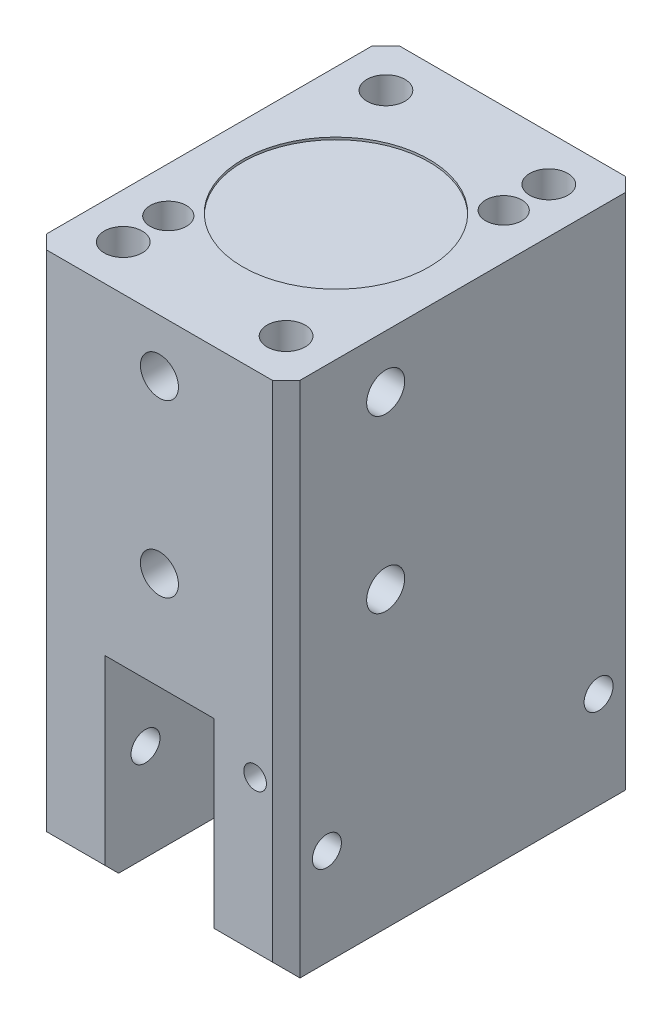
ISO-10303-21;
HEADER;
FILE_DESCRIPTION(('STEP AP214'),'2;1');
FILE_NAME('part.step','',(''),(''),'','','');
FILE_SCHEMA(('AUTOMOTIVE_DESIGN { 1 0 10303 214 1 1 1 1 }'));
ENDSEC;
DATA;
#1=APPLICATION_CONTEXT('core data for automotive mechanical design processes');
#2=APPLICATION_PROTOCOL_DEFINITION('international standard','automotive_design',2000,#1);
#3=PRODUCT_CONTEXT('',#1,'mechanical');
#4=PRODUCT('Part','Part','',(#3));
#5=PRODUCT_RELATED_PRODUCT_CATEGORY('part','',(#4));
#6=PRODUCT_DEFINITION_FORMATION('','',#4);
#7=PRODUCT_DEFINITION_CONTEXT('part definition',#1,'design');
#8=PRODUCT_DEFINITION('design','',#6,#7);
#9=PRODUCT_DEFINITION_SHAPE('','',#8);
#10=(LENGTH_UNIT() NAMED_UNIT(*) SI_UNIT(.MILLI.,.METRE.));
#11=(NAMED_UNIT(*) PLANE_ANGLE_UNIT() SI_UNIT($,.RADIAN.));
#12=(NAMED_UNIT(*) SI_UNIT($,.STERADIAN.) SOLID_ANGLE_UNIT());
#13=UNCERTAINTY_MEASURE_WITH_UNIT(LENGTH_MEASURE(1.E-05),#10,'distance_accuracy_value','');
#14=(GEOMETRIC_REPRESENTATION_CONTEXT(3) GLOBAL_UNCERTAINTY_ASSIGNED_CONTEXT((#13)) GLOBAL_UNIT_ASSIGNED_CONTEXT((#10,
#11,#12)) REPRESENTATION_CONTEXT('',''));
#15=CARTESIAN_POINT('',(0.,0.,0.));
#16=DIRECTION('',(0.,0.,1.));
#17=DIRECTION('',(1.,0.,0.));
#18=AXIS2_PLACEMENT_3D('',#15,#16,#17);
#19=CARTESIAN_POINT('',(-8.9916,28.575,14.5034));
#20=DIRECTION('',(0.,1.,0.));
#21=DIRECTION('',(0.,0.,1.));
#22=AXIS2_PLACEMENT_3D('',#19,#20,#21);
#23=CYLINDRICAL_SURFACE('',#22,2.1);
#24=CARTESIAN_POINT('',(-8.9916,28.575,14.5034));
#25=DIRECTION('',(0.,1.,0.));
#26=DIRECTION('',(0.,0.,1.));
#27=AXIS2_PLACEMENT_3D('',#24,#25,#26);
#28=CIRCLE('',#27,2.1);
#29=CARTESIAN_POINT('',(-8.9916,28.575,16.6034));
#30=VERTEX_POINT('',#29);
#31=EDGE_CURVE('E371',#30,#30,#28,.T.);
#32=ORIENTED_EDGE('',*,*,#31,.T.);
#33=EDGE_LOOP('',(#32));
#34=FACE_BOUND('',#33,.T.);
#35=CARTESIAN_POINT('',(-8.9916,23.5712,14.5034));
#36=DIRECTION('',(0.707106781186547,0.707106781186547,0.));
#37=DIRECTION('',(-0.707106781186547,0.707106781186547,0.));
#38=AXIS2_PLACEMENT_3D('',#35,#36,#37);
#39=ELLIPSE('',#38,2.9698484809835,2.1);
#40=CARTESIAN_POINT('',(-8.9916,23.5712,16.6034));
#41=VERTEX_POINT('',#40);
#42=CARTESIAN_POINT('',(-8.9916,23.5712,12.4034));
#43=VERTEX_POINT('',#42);
#44=EDGE_CURVE('E403',#41,#43,#39,.F.);
#45=ORIENTED_EDGE('',*,*,#44,.T.);
#46=CARTESIAN_POINT('',(-8.9916,23.5712,14.5034));
#47=DIRECTION('',(-0.707106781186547,0.707106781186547,0.));
#48=DIRECTION('',(0.707106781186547,0.707106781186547,0.));
#49=AXIS2_PLACEMENT_3D('',#46,#47,#48);
#50=ELLIPSE('',#49,2.9698484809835,2.1);
#51=EDGE_CURVE('E411',#43,#41,#50,.F.);
#52=ORIENTED_EDGE('',*,*,#51,.T.);
#53=EDGE_LOOP('',(#45,#52));
#54=FACE_BOUND('',#53,.T.);
#55=ADVANCED_FACE('F36',(#34,#54),#23,.F.);
#56=CARTESIAN_POINT('',(-8.9916,28.575,-14.5034));
#57=DIRECTION('',(0.,1.,0.));
#58=DIRECTION('',(0.,0.,1.));
#59=AXIS2_PLACEMENT_3D('',#56,#57,#58);
#60=CYLINDRICAL_SURFACE('',#59,2.1);
#61=CARTESIAN_POINT('',(-8.9916,28.575,-14.5034));
#62=DIRECTION('',(0.,1.,0.));
#63=DIRECTION('',(0.,0.,1.));
#64=AXIS2_PLACEMENT_3D('',#61,#62,#63);
#65=CIRCLE('',#64,2.1);
#66=CARTESIAN_POINT('',(-8.9916,28.575,-12.4034));
#67=VERTEX_POINT('',#66);
#68=EDGE_CURVE('E365',#67,#67,#65,.T.);
#69=ORIENTED_EDGE('',*,*,#68,.T.);
#70=EDGE_LOOP('',(#69));
#71=FACE_BOUND('',#70,.T.);
#72=CARTESIAN_POINT('',(-8.9916,23.5712,-14.5034));
#73=DIRECTION('',(0.707106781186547,0.707106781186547,0.));
#74=DIRECTION('',(-0.707106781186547,0.707106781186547,0.));
#75=AXIS2_PLACEMENT_3D('',#72,#73,#74);
#76=ELLIPSE('',#75,2.9698484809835,2.1);
#77=CARTESIAN_POINT('',(-8.9916,23.5712,-12.4034));
#78=VERTEX_POINT('',#77);
#79=CARTESIAN_POINT('',(-8.9916,23.5712,-16.6034));
#80=VERTEX_POINT('',#79);
#81=EDGE_CURVE('E388',#78,#80,#76,.F.);
#82=ORIENTED_EDGE('',*,*,#81,.T.);
#83=CARTESIAN_POINT('',(-8.9916,23.5712,-14.5034));
#84=DIRECTION('',(-0.707106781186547,0.707106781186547,0.));
#85=DIRECTION('',(0.707106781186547,0.707106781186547,0.));
#86=AXIS2_PLACEMENT_3D('',#83,#84,#85);
#87=ELLIPSE('',#86,2.9698484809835,2.1);
#88=EDGE_CURVE('E400',#80,#78,#87,.F.);
#89=ORIENTED_EDGE('',*,*,#88,.T.);
#90=EDGE_LOOP('',(#82,#89));
#91=FACE_BOUND('',#90,.T.);
#92=ADVANCED_FACE('F558',(#71,#91),#60,.F.);
#93=CARTESIAN_POINT('',(-13.9954,-28.575,19.4945));
#94=DIRECTION('',(0.,1.,0.));
#95=DIRECTION('',(0.,0.,1.));
#96=AXIS2_PLACEMENT_3D('',#93,#94,#95);
#97=PLANE('',#96);
#98=CARTESIAN_POINT('',(-10.0203,-28.575,0.));
#99=DIRECTION('',(0.,-1.,0.));
#100=DIRECTION('',(0.,0.,-1.));
#101=AXIS2_PLACEMENT_3D('',#98,#99,#100);
#102=CIRCLE('',#101,1.65);
#103=CARTESIAN_POINT('',(-10.0203,-28.575,-1.65));
#104=VERTEX_POINT('',#103);
#105=EDGE_CURVE('E218',#104,#104,#102,.T.);
#106=ORIENTED_EDGE('',*,*,#105,.F.);
#107=EDGE_LOOP('',(#106));
#108=FACE_BOUND('',#107,.T.);
#109=DIRECTION('',(0.,0.,1.));
#110=VECTOR('',#109,1.);
#111=CARTESIAN_POINT('',(-6.0325,-28.575,-19.4945));
#112=LINE('',#111,#110);
#113=CARTESIAN_POINT('',(-6.0325,-28.575,-17.9705));
#114=VERTEX_POINT('',#113);
#115=CARTESIAN_POINT('',(-6.0325,-28.575,17.9705));
#116=VERTEX_POINT('',#115);
#117=EDGE_CURVE('E293',#114,#116,#112,.T.);
#118=ORIENTED_EDGE('',*,*,#117,.T.);
#119=DIRECTION('',(-1.,0.,0.));
#120=VECTOR('',#119,1.);
#121=CARTESIAN_POINT('',(-13.9954,-28.575,17.9705));
#122=LINE('',#121,#120);
#123=CARTESIAN_POINT('',(-13.9954,-28.575,17.9705));
#124=VERTEX_POINT('',#123);
#125=EDGE_CURVE('E474',#116,#124,#122,.T.);
#126=ORIENTED_EDGE('',*,*,#125,.T.);
#127=DIRECTION('',(0.,0.,1.));
#128=VECTOR('',#127,1.);
#129=CARTESIAN_POINT('',(-13.9954,-28.575,-19.4945));
#130=LINE('',#129,#128);
#131=CARTESIAN_POINT('',(-13.9954,-28.575,-17.9705));
#132=VERTEX_POINT('',#131);
#133=EDGE_CURVE('E374',#132,#124,#130,.T.);
#134=ORIENTED_EDGE('',*,*,#133,.F.);
#135=DIRECTION('',(1.,0.,0.));
#136=VECTOR('',#135,1.);
#137=CARTESIAN_POINT('',(-13.9954,-28.575,-17.9705));
#138=LINE('',#137,#136);
#139=EDGE_CURVE('E58',#132,#114,#138,.T.);
#140=ORIENTED_EDGE('',*,*,#139,.T.);
#141=EDGE_LOOP('',(#118,#126,#134,#140));
#142=FACE_BOUND('',#141,.T.);
#143=ADVANCED_FACE('F490',(#108,#142),#97,.F.);
#144=CARTESIAN_POINT('',(-13.9954,28.575,-19.4945));
#145=DIRECTION('',(1.,0.,0.));
#146=DIRECTION('',(0.,0.,-1.));
#147=AXIS2_PLACEMENT_3D('',#144,#145,#146);
#148=PLANE('',#147);
#149=CARTESIAN_POINT('',(-13.9954,-17.907,14.9987));
#150=DIRECTION('',(-1.,0.,0.));
#151=DIRECTION('',(0.,0.,1.));
#152=AXIS2_PLACEMENT_3D('',#149,#150,#151);
#153=CIRCLE('',#152,1.6);
#154=CARTESIAN_POINT('',(-13.9954,-17.907,16.5987));
#155=VERTEX_POINT('',#154);
#156=EDGE_CURVE('E227',#155,#155,#153,.T.);
#157=ORIENTED_EDGE('',*,*,#156,.F.);
#158=EDGE_LOOP('',(#157));
#159=FACE_BOUND('',#158,.T.);
#160=CARTESIAN_POINT('',(-13.9954,-17.907,-14.9987));
#161=DIRECTION('',(-1.,0.,0.));
#162=DIRECTION('',(0.,0.,1.));
#163=AXIS2_PLACEMENT_3D('',#160,#161,#162);
#164=CIRCLE('',#163,1.6);
#165=CARTESIAN_POINT('',(-13.9954,-17.907,-13.3987));
#166=VERTEX_POINT('',#165);
#167=EDGE_CURVE('E237',#166,#166,#164,.T.);
#168=ORIENTED_EDGE('',*,*,#167,.F.);
#169=EDGE_LOOP('',(#168));
#170=FACE_BOUND('',#169,.T.);
#171=CARTESIAN_POINT('',(-13.9954,14.3256,14.5034));
#172=DIRECTION('',(-1.,0.,0.));
#173=DIRECTION('',(0.,0.,1.));
#174=AXIS2_PLACEMENT_3D('',#171,#172,#173);
#175=CIRCLE('',#174,1.5);
#176=CARTESIAN_POINT('',(-13.9954,14.3256,16.0034));
#177=VERTEX_POINT('',#176);
#178=EDGE_CURVE('E247',#177,#177,#175,.T.);
#179=ORIENTED_EDGE('',*,*,#178,.F.);
#180=EDGE_LOOP('',(#179));
#181=FACE_BOUND('',#180,.T.);
#182=CARTESIAN_POINT('',(-13.9954,14.3256,-14.5034));
#183=DIRECTION('',(-1.,0.,0.));
#184=DIRECTION('',(0.,0.,1.));
#185=AXIS2_PLACEMENT_3D('',#182,#183,#184);
#186=CIRCLE('',#185,1.5);
#187=CARTESIAN_POINT('',(-13.9954,14.3256,-13.0034));
#188=VERTEX_POINT('',#187);
#189=EDGE_CURVE('E251',#188,#188,#186,.T.);
#190=ORIENTED_EDGE('',*,*,#189,.F.);
#191=EDGE_LOOP('',(#190));
#192=FACE_BOUND('',#191,.T.);
#193=CARTESIAN_POINT('',(-13.9954,5.08,14.5034));
#194=DIRECTION('',(-1.,0.,0.));
#195=DIRECTION('',(0.,0.,1.));
#196=AXIS2_PLACEMENT_3D('',#193,#194,#195);
#197=CIRCLE('',#196,2.1);
#198=CARTESIAN_POINT('',(-13.9954,5.08,16.6034));
#199=VERTEX_POINT('',#198);
#200=EDGE_CURVE('E262',#199,#199,#197,.T.);
#201=ORIENTED_EDGE('',*,*,#200,.F.);
#202=EDGE_LOOP('',(#201));
#203=FACE_BOUND('',#202,.T.);
#204=CARTESIAN_POINT('',(-13.9954,23.5712,14.5034));
#205=DIRECTION('',(-1.,0.,0.));
#206=DIRECTION('',(0.,0.,1.));
#207=AXIS2_PLACEMENT_3D('',#204,#205,#206);
#208=CIRCLE('',#207,2.1);
#209=CARTESIAN_POINT('',(-13.9954,23.5712,16.6034));
#210=VERTEX_POINT('',#209);
#211=EDGE_CURVE('E268',#210,#210,#208,.T.);
#212=ORIENTED_EDGE('',*,*,#211,.F.);
#213=EDGE_LOOP('',(#212));
#214=FACE_BOUND('',#213,.T.);
#215=CARTESIAN_POINT('',(-13.9954,23.5712,-14.5034));
#216=DIRECTION('',(-1.,0.,0.));
#217=DIRECTION('',(0.,0.,1.));
#218=AXIS2_PLACEMENT_3D('',#215,#216,#217);
#219=CIRCLE('',#218,2.1);
#220=CARTESIAN_POINT('',(-13.9954,23.5712,-12.4034));
#221=VERTEX_POINT('',#220);
#222=EDGE_CURVE('E274',#221,#221,#219,.T.);
#223=ORIENTED_EDGE('',*,*,#222,.F.);
#224=EDGE_LOOP('',(#223));
#225=FACE_BOUND('',#224,.T.);
#226=CARTESIAN_POINT('',(-13.9954,5.08,-14.5034));
#227=DIRECTION('',(-1.,0.,0.));
#228=DIRECTION('',(0.,0.,1.));
#229=AXIS2_PLACEMENT_3D('',#226,#227,#228);
#230=CIRCLE('',#229,2.1);
#231=CARTESIAN_POINT('',(-13.9954,5.08,-12.4034));
#232=VERTEX_POINT('',#231);
#233=EDGE_CURVE('E280',#232,#232,#230,.T.);
#234=ORIENTED_EDGE('',*,*,#233,.F.);
#235=EDGE_LOOP('',(#234));
#236=FACE_BOUND('',#235,.T.);
#237=DIRECTION('',(0.,0.,1.));
#238=VECTOR('',#237,1.);
#239=CARTESIAN_POINT('',(-13.9954,28.575,-19.4945));
#240=LINE('',#239,#238);
#241=CARTESIAN_POINT('',(-13.9954,28.575,-17.9705));
#242=VERTEX_POINT('',#241);
#243=CARTESIAN_POINT('',(-13.9954,28.575,17.9705));
#244=VERTEX_POINT('',#243);
#245=EDGE_CURVE('E375',#242,#244,#240,.T.);
#246=ORIENTED_EDGE('',*,*,#245,.F.);
#247=DIRECTION('',(0.,-1.,0.));
#248=VECTOR('',#247,1.);
#249=CARTESIAN_POINT('',(-13.9954,28.575,-17.9705));
#250=LINE('',#249,#248);
#251=EDGE_CURVE('E420',#242,#132,#250,.T.);
#252=ORIENTED_EDGE('',*,*,#251,.T.);
#253=ORIENTED_EDGE('',*,*,#133,.T.);
#254=DIRECTION('',(0.,1.,0.));
#255=VECTOR('',#254,1.);
#256=CARTESIAN_POINT('',(-13.9954,28.575,17.9705));
#257=LINE('',#256,#255);
#258=EDGE_CURVE('E414',#124,#244,#257,.T.);
#259=ORIENTED_EDGE('',*,*,#258,.T.);
#260=EDGE_LOOP('',(#246,#252,#253,#259));
#261=FACE_BOUND('',#260,.T.);
#262=ADVANCED_FACE('F493',(#159,#170,#181,#192,#203,#214,#225,#236,#261),#148,.F.);
#263=CARTESIAN_POINT('',(-13.9954,28.575,19.4945));
#264=DIRECTION('',(0.,0.,-1.));
#265=DIRECTION('',(-1.,0.,0.));
#266=AXIS2_PLACEMENT_3D('',#263,#264,#265);
#267=PLANE('',#266);
#268=CARTESIAN_POINT('',(10.5664,-10.3378,19.4945));
#269=DIRECTION('',(0.,0.,1.));
#270=DIRECTION('',(1.,0.,0.));
#271=AXIS2_PLACEMENT_3D('',#268,#269,#270);
#272=CIRCLE('',#271,1.25);
#273=CARTESIAN_POINT('',(11.8164,-10.3378,19.4945));
#274=VERTEX_POINT('',#273);
#275=EDGE_CURVE('E224',#274,#274,#272,.T.);
#276=ORIENTED_EDGE('',*,*,#275,.F.);
#277=EDGE_LOOP('',(#276));
#278=FACE_BOUND('',#277,.T.);
#279=CARTESIAN_POINT('',(0.,22.733,19.4945));
#280=DIRECTION('',(0.,0.,1.));
#281=DIRECTION('',(1.,0.,0.));
#282=AXIS2_PLACEMENT_3D('',#279,#280,#281);
#283=CIRCLE('',#282,2.1);
#284=CARTESIAN_POINT('',(2.1,22.733,19.4945));
#285=VERTEX_POINT('',#284);
#286=EDGE_CURVE('E311',#285,#285,#283,.T.);
#287=ORIENTED_EDGE('',*,*,#286,.F.);
#288=EDGE_LOOP('',(#287));
#289=FACE_BOUND('',#288,.T.);
#290=CARTESIAN_POINT('',(0.,3.8608,19.4945));
#291=DIRECTION('',(0.,0.,1.));
#292=DIRECTION('',(1.,0.,0.));
#293=AXIS2_PLACEMENT_3D('',#290,#291,#292);
#294=CIRCLE('',#293,2.1);
#295=CARTESIAN_POINT('',(2.1,3.8608,19.4945));
#296=VERTEX_POINT('',#295);
#297=EDGE_CURVE('E317',#296,#296,#294,.T.);
#298=ORIENTED_EDGE('',*,*,#297,.F.);
#299=EDGE_LOOP('',(#298));
#300=FACE_BOUND('',#299,.T.);
#301=DIRECTION('',(0.,1.,0.));
#302=VECTOR('',#301,1.);
#303=CARTESIAN_POINT('',(6.0325,-28.575,19.4945));
#304=LINE('',#303,#302);
#305=CARTESIAN_POINT('',(6.0325,-27.051,19.4945));
#306=VERTEX_POINT('',#305);
#307=CARTESIAN_POINT('',(6.0325,-6.98499999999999,19.4945));
#308=VERTEX_POINT('',#307);
#309=EDGE_CURVE('E295',#306,#308,#304,.T.);
#310=ORIENTED_EDGE('',*,*,#309,.F.);
#311=DIRECTION('',(1.,0.,0.));
#312=VECTOR('',#311,1.);
#313=CARTESIAN_POINT('',(-13.9954,-27.051,19.4945));
#314=LINE('',#313,#312);
#315=CARTESIAN_POINT('',(12.4714,-27.051,19.4945));
#316=VERTEX_POINT('',#315);
#317=EDGE_CURVE('E449',#306,#316,#314,.T.);
#318=ORIENTED_EDGE('',*,*,#317,.T.);
#319=DIRECTION('',(0.,1.,0.));
#320=VECTOR('',#319,1.);
#321=CARTESIAN_POINT('',(12.4714,28.575,19.4945));
#322=LINE('',#321,#320);
#323=CARTESIAN_POINT('',(12.4714,28.575,19.4945));
#324=VERTEX_POINT('',#323);
#325=EDGE_CURVE('E441',#316,#324,#322,.T.);
#326=ORIENTED_EDGE('',*,*,#325,.T.);
#327=DIRECTION('',(1.,0.,0.));
#328=VECTOR('',#327,1.);
#329=CARTESIAN_POINT('',(-13.9954,28.575,19.4945));
#330=LINE('',#329,#328);
#331=CARTESIAN_POINT('',(-12.4714,28.575,19.4945));
#332=VERTEX_POINT('',#331);
#333=EDGE_CURVE('E378',#332,#324,#330,.T.);
#334=ORIENTED_EDGE('',*,*,#333,.F.);
#335=DIRECTION('',(0.,-1.,0.));
#336=VECTOR('',#335,1.);
#337=CARTESIAN_POINT('',(-12.4714,28.575,19.4945));
#338=LINE('',#337,#336);
#339=CARTESIAN_POINT('',(-12.4714,-27.051,19.4945));
#340=VERTEX_POINT('',#339);
#341=EDGE_CURVE('E443',#332,#340,#338,.T.);
#342=ORIENTED_EDGE('',*,*,#341,.T.);
#343=DIRECTION('',(1.,0.,0.));
#344=VECTOR('',#343,1.);
#345=CARTESIAN_POINT('',(-13.9954,-27.051,19.4945));
#346=LINE('',#345,#344);
#347=CARTESIAN_POINT('',(-6.0325,-27.051,19.4945));
#348=VERTEX_POINT('',#347);
#349=EDGE_CURVE('E446',#340,#348,#346,.T.);
#350=ORIENTED_EDGE('',*,*,#349,.T.);
#351=DIRECTION('',(0.,-1.,0.));
#352=VECTOR('',#351,1.);
#353=CARTESIAN_POINT('',(-6.0325,-28.575,19.4945));
#354=LINE('',#353,#352);
#355=CARTESIAN_POINT('',(-6.0325,-6.98499999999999,19.4945));
#356=VERTEX_POINT('',#355);
#357=EDGE_CURVE('E283',#356,#348,#354,.T.);
#358=ORIENTED_EDGE('',*,*,#357,.F.);
#359=DIRECTION('',(-1.,0.,0.));
#360=VECTOR('',#359,1.);
#361=CARTESIAN_POINT('',(-6.0325,-6.98499999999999,19.4945));
#362=LINE('',#361,#360);
#363=EDGE_CURVE('E288',#308,#356,#362,.T.);
#364=ORIENTED_EDGE('',*,*,#363,.F.);
#365=EDGE_LOOP('',(#310,#318,#326,#334,#342,#350,#358,#364));
#366=FACE_BOUND('',#365,.T.);
#367=ADVANCED_FACE('F487',(#278,#289,#300,#366),#267,.F.);
#368=CARTESIAN_POINT('',(13.9954,28.575,-19.4945));
#369=DIRECTION('',(-1.,0.,0.));
#370=DIRECTION('',(0.,0.,1.));
#371=AXIS2_PLACEMENT_3D('',#368,#369,#370);
#372=PLANE('',#371);
#373=CARTESIAN_POINT('',(13.9954,-17.907,14.9987));
#374=DIRECTION('',(-1.,0.,0.));
#375=DIRECTION('',(0.,0.,1.));
#376=AXIS2_PLACEMENT_3D('',#373,#374,#375);
#377=CIRCLE('',#376,1.6);
#378=CARTESIAN_POINT('',(13.9954,-17.907,16.5987));
#379=VERTEX_POINT('',#378);
#380=EDGE_CURVE('E228',#379,#379,#377,.T.);
#381=ORIENTED_EDGE('',*,*,#380,.T.);
#382=EDGE_LOOP('',(#381));
#383=FACE_BOUND('',#382,.T.);
#384=CARTESIAN_POINT('',(13.9954,-17.907,-14.9987));
#385=DIRECTION('',(-1.,0.,0.));
#386=DIRECTION('',(0.,0.,1.));
#387=AXIS2_PLACEMENT_3D('',#384,#385,#386);
#388=CIRCLE('',#387,1.6);
#389=CARTESIAN_POINT('',(13.9954,-17.907,-13.3987));
#390=VERTEX_POINT('',#389);
#391=EDGE_CURVE('E238',#390,#390,#388,.T.);
#392=ORIENTED_EDGE('',*,*,#391,.T.);
#393=EDGE_LOOP('',(#392));
#394=FACE_BOUND('',#393,.T.);
#395=CARTESIAN_POINT('',(13.9954,22.733,8.509));
#396=DIRECTION('',(1.,0.,0.));
#397=DIRECTION('',(0.,0.,-1.));
#398=AXIS2_PLACEMENT_3D('',#395,#396,#397);
#399=CIRCLE('',#398,2.1);
#400=CARTESIAN_POINT('',(13.9954,22.733,6.409));
#401=VERTEX_POINT('',#400);
#402=EDGE_CURVE('E323',#401,#401,#399,.T.);
#403=ORIENTED_EDGE('',*,*,#402,.F.);
#404=EDGE_LOOP('',(#403));
#405=FACE_BOUND('',#404,.T.);
#406=CARTESIAN_POINT('',(13.9954,3.8608,8.509));
#407=DIRECTION('',(1.,0.,0.));
#408=DIRECTION('',(0.,0.,-1.));
#409=AXIS2_PLACEMENT_3D('',#406,#407,#408);
#410=CIRCLE('',#409,2.1);
#411=CARTESIAN_POINT('',(13.9954,3.8608,6.409));
#412=VERTEX_POINT('',#411);
#413=EDGE_CURVE('E329',#412,#412,#410,.T.);
#414=ORIENTED_EDGE('',*,*,#413,.F.);
#415=EDGE_LOOP('',(#414));
#416=FACE_BOUND('',#415,.T.);
#417=DIRECTION('',(0.,0.,-1.));
#418=VECTOR('',#417,1.);
#419=CARTESIAN_POINT('',(13.9954,-28.575,-19.4945));
#420=LINE('',#419,#418);
#421=CARTESIAN_POINT('',(13.9954,-28.575,17.9705));
#422=VERTEX_POINT('',#421);
#423=CARTESIAN_POINT('',(13.9954,-28.575,-17.9705));
#424=VERTEX_POINT('',#423);
#425=EDGE_CURVE('E379',#422,#424,#420,.T.);
#426=ORIENTED_EDGE('',*,*,#425,.T.);
#427=DIRECTION('',(0.,1.,0.));
#428=VECTOR('',#427,1.);
#429=CARTESIAN_POINT('',(13.9954,28.575,-17.9705));
#430=LINE('',#429,#428);
#431=CARTESIAN_POINT('',(13.9954,28.575,-17.9705));
#432=VERTEX_POINT('',#431);
#433=EDGE_CURVE('E439',#424,#432,#430,.T.);
#434=ORIENTED_EDGE('',*,*,#433,.T.);
#435=DIRECTION('',(0.,0.,-1.));
#436=VECTOR('',#435,1.);
#437=CARTESIAN_POINT('',(13.9954,28.575,-19.4945));
#438=LINE('',#437,#436);
#439=CARTESIAN_POINT('',(13.9954,28.575,17.9705));
#440=VERTEX_POINT('',#439);
#441=EDGE_CURVE('E382',#440,#432,#438,.T.);
#442=ORIENTED_EDGE('',*,*,#441,.F.);
#443=DIRECTION('',(0.,-1.,0.));
#444=VECTOR('',#443,1.);
#445=CARTESIAN_POINT('',(13.9954,28.575,17.9705));
#446=LINE('',#445,#444);
#447=EDGE_CURVE('E436',#440,#422,#446,.T.);
#448=ORIENTED_EDGE('',*,*,#447,.T.);
#449=EDGE_LOOP('',(#426,#434,#442,#448));
#450=FACE_BOUND('',#449,.T.);
#451=ADVANCED_FACE('F526',(#383,#394,#405,#416,#450),#372,.F.);
#452=CARTESIAN_POINT('',(-13.9954,28.575,-19.4945));
#453=DIRECTION('',(0.,0.,1.));
#454=DIRECTION('',(1.,0.,0.));
#455=AXIS2_PLACEMENT_3D('',#452,#453,#454);
#456=PLANE('',#455);
#457=DIRECTION('',(0.,-1.,0.));
#458=VECTOR('',#457,1.);
#459=CARTESIAN_POINT('',(12.4714,28.575,-19.4945));
#460=LINE('',#459,#458);
#461=CARTESIAN_POINT('',(12.4714,28.575,-19.4945));
#462=VERTEX_POINT('',#461);
#463=CARTESIAN_POINT('',(12.4714,-27.051,-19.4945));
#464=VERTEX_POINT('',#463);
#465=EDGE_CURVE('E423',#462,#464,#460,.T.);
#466=ORIENTED_EDGE('',*,*,#465,.T.);
#467=DIRECTION('',(-1.,0.,0.));
#468=VECTOR('',#467,1.);
#469=CARTESIAN_POINT('',(-13.9954,-27.051,-19.4945));
#470=LINE('',#469,#468);
#471=CARTESIAN_POINT('',(6.0325,-27.051,-19.4945));
#472=VERTEX_POINT('',#471);
#473=EDGE_CURVE('E465',#464,#472,#470,.T.);
#474=ORIENTED_EDGE('',*,*,#473,.T.);
#475=DIRECTION('',(0.,1.,0.));
#476=VECTOR('',#475,1.);
#477=CARTESIAN_POINT('',(6.0325,-28.575,-19.4945));
#478=LINE('',#477,#476);
#479=CARTESIAN_POINT('',(6.0325,-6.98499999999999,-19.4945));
#480=VERTEX_POINT('',#479);
#481=EDGE_CURVE('E287',#472,#480,#478,.T.);
#482=ORIENTED_EDGE('',*,*,#481,.T.);
#483=DIRECTION('',(-1.,0.,0.));
#484=VECTOR('',#483,1.);
#485=CARTESIAN_POINT('',(-6.0325,-6.98499999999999,-19.4945));
#486=LINE('',#485,#484);
#487=CARTESIAN_POINT('',(-6.0325,-6.98499999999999,-19.4945));
#488=VERTEX_POINT('',#487);
#489=EDGE_CURVE('E290',#480,#488,#486,.T.);
#490=ORIENTED_EDGE('',*,*,#489,.T.);
#491=DIRECTION('',(0.,-1.,0.));
#492=VECTOR('',#491,1.);
#493=CARTESIAN_POINT('',(-6.0325,-28.575,-19.4945));
#494=LINE('',#493,#492);
#495=CARTESIAN_POINT('',(-6.0325,-27.051,-19.4945));
#496=VERTEX_POINT('',#495);
#497=EDGE_CURVE('E284',#488,#496,#494,.T.);
#498=ORIENTED_EDGE('',*,*,#497,.T.);
#499=DIRECTION('',(-1.,0.,0.));
#500=VECTOR('',#499,1.);
#501=CARTESIAN_POINT('',(-13.9954,-27.051,-19.4945));
#502=LINE('',#501,#500);
#503=CARTESIAN_POINT('',(-12.4714,-27.051,-19.4945));
#504=VERTEX_POINT('',#503);
#505=EDGE_CURVE('E462',#496,#504,#502,.T.);
#506=ORIENTED_EDGE('',*,*,#505,.T.);
#507=DIRECTION('',(0.,1.,0.));
#508=VECTOR('',#507,1.);
#509=CARTESIAN_POINT('',(-12.4714,28.575,-19.4945));
#510=LINE('',#509,#508);
#511=CARTESIAN_POINT('',(-12.4714,28.575,-19.4945));
#512=VERTEX_POINT('',#511);
#513=EDGE_CURVE('E426',#504,#512,#510,.T.);
#514=ORIENTED_EDGE('',*,*,#513,.T.);
#515=DIRECTION('',(-1.,0.,0.));
#516=VECTOR('',#515,1.);
#517=CARTESIAN_POINT('',(-13.9954,28.575,-19.4945));
#518=LINE('',#517,#516);
#519=EDGE_CURVE('E385',#462,#512,#518,.T.);
#520=ORIENTED_EDGE('',*,*,#519,.F.);
#521=EDGE_LOOP('',(#466,#474,#482,#490,#498,#506,#514,#520));
#522=FACE_BOUND('',#521,.T.);
#523=ADVANCED_FACE('F503',(#522),#456,.F.);
#524=CARTESIAN_POINT('',(-13.9954,28.575,19.4945));
#525=DIRECTION('',(0.,1.,0.));
#526=DIRECTION('',(0.,0.,1.));
#527=AXIS2_PLACEMENT_3D('',#524,#525,#526);
#528=PLANE('',#527);
#529=CARTESIAN_POINT('',(8.99159999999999,28.575,-9.525));
#530=DIRECTION('',(0.,1.,0.));
#531=DIRECTION('',(0.,0.,1.));
#532=AXIS2_PLACEMENT_3D('',#529,#530,#531);
#533=CIRCLE('',#532,2.);
#534=CARTESIAN_POINT('',(8.99159999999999,28.575,-7.525));
#535=VERTEX_POINT('',#534);
#536=EDGE_CURVE('E332',#535,#535,#533,.T.);
#537=ORIENTED_EDGE('',*,*,#536,.F.);
#538=EDGE_LOOP('',(#537));
#539=FACE_BOUND('',#538,.T.);
#540=CARTESIAN_POINT('',(-8.9916,28.575,9.525));
#541=DIRECTION('',(0.,1.,0.));
#542=DIRECTION('',(0.,0.,1.));
#543=AXIS2_PLACEMENT_3D('',#540,#541,#542);
#544=CIRCLE('',#543,2.);
#545=CARTESIAN_POINT('',(-8.9916,28.575,11.525));
#546=VERTEX_POINT('',#545);
#547=EDGE_CURVE('E336',#546,#546,#544,.T.);
#548=ORIENTED_EDGE('',*,*,#547,.F.);
#549=EDGE_LOOP('',(#548));
#550=FACE_BOUND('',#549,.T.);
#551=CARTESIAN_POINT('',(0.,28.575,0.));
#552=DIRECTION('',(0.,1.,0.));
#553=DIRECTION('',(0.,0.,1.));
#554=AXIS2_PLACEMENT_3D('',#551,#552,#553);
#555=CIRCLE('',#554,10.287);
#556=CARTESIAN_POINT('',(0.,28.575,10.287));
#557=VERTEX_POINT('',#556);
#558=EDGE_CURVE('E342',#557,#557,#555,.T.);
#559=ORIENTED_EDGE('',*,*,#558,.F.);
#560=EDGE_LOOP('',(#559));
#561=FACE_BOUND('',#560,.T.);
#562=CARTESIAN_POINT('',(8.9916,28.575,-14.5034));
#563=DIRECTION('',(0.,1.,0.));
#564=DIRECTION('',(0.,0.,1.));
#565=AXIS2_PLACEMENT_3D('',#562,#563,#564);
#566=CIRCLE('',#565,2.1);
#567=CARTESIAN_POINT('',(8.9916,28.575,-12.4034));
#568=VERTEX_POINT('',#567);
#569=EDGE_CURVE('E353',#568,#568,#566,.T.);
#570=ORIENTED_EDGE('',*,*,#569,.F.);
#571=EDGE_LOOP('',(#570));
#572=FACE_BOUND('',#571,.T.);
#573=CARTESIAN_POINT('',(8.9916,28.575,14.5034));
#574=DIRECTION('',(0.,1.,0.));
#575=DIRECTION('',(0.,0.,1.));
#576=AXIS2_PLACEMENT_3D('',#573,#574,#575);
#577=CIRCLE('',#576,2.1);
#578=CARTESIAN_POINT('',(8.9916,28.575,16.6034));
#579=VERTEX_POINT('',#578);
#580=EDGE_CURVE('E359',#579,#579,#577,.T.);
#581=ORIENTED_EDGE('',*,*,#580,.F.);
#582=EDGE_LOOP('',(#581));
#583=FACE_BOUND('',#582,.T.);
#584=ORIENTED_EDGE('',*,*,#68,.F.);
#585=EDGE_LOOP('',(#584));
#586=FACE_BOUND('',#585,.T.);
#587=ORIENTED_EDGE('',*,*,#31,.F.);
#588=EDGE_LOOP('',(#587));
#589=FACE_BOUND('',#588,.T.);
#590=ORIENTED_EDGE('',*,*,#519,.T.);
#591=DIRECTION('',(0.70710678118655,0.,-0.707106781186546));
#592=VECTOR('',#591,1.);
#593=CARTESIAN_POINT('',(-32.7279,28.575,0.761999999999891));
#594=LINE('',#593,#592);
#595=EDGE_CURVE('E434',#512,#242,#594,.F.);
#596=ORIENTED_EDGE('',*,*,#595,.T.);
#597=ORIENTED_EDGE('',*,*,#245,.T.);
#598=DIRECTION('',(-0.707106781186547,0.,-0.707106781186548));
#599=VECTOR('',#598,1.);
#600=CARTESIAN_POINT('',(-13.2334,28.575,18.7325));
#601=LINE('',#600,#599);
#602=EDGE_CURVE('E430',#244,#332,#601,.F.);
#603=ORIENTED_EDGE('',*,*,#602,.T.);
#604=ORIENTED_EDGE('',*,*,#333,.T.);
#605=DIRECTION('',(-0.70710678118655,0.,0.707106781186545));
#606=VECTOR('',#605,1.);
#607=CARTESIAN_POINT('',(-0.762000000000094,28.575,32.7279));
#608=LINE('',#607,#606);
#609=EDGE_CURVE('E428',#324,#440,#608,.F.);
#610=ORIENTED_EDGE('',*,*,#609,.T.);
#611=ORIENTED_EDGE('',*,*,#441,.T.);
#612=DIRECTION('',(0.707106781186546,0.,0.707106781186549));
#613=VECTOR('',#612,1.);
#614=CARTESIAN_POINT('',(18.7325000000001,28.575,-13.2333999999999));
#615=LINE('',#614,#613);
#616=EDGE_CURVE('E432',#432,#462,#615,.F.);
#617=ORIENTED_EDGE('',*,*,#616,.T.);
#618=EDGE_LOOP('',(#590,#596,#597,#603,#604,#610,#611,#617));
#619=FACE_BOUND('',#618,.T.);
#620=ADVANCED_FACE('F542',(#539,#550,#561,#572,#583,#586,#589,#619),#528,.T.);
#621=CARTESIAN_POINT('',(10.5664,-28.575,-14.7193));
#622=DIRECTION('',(0.,-1.,0.));
#623=DIRECTION('',(0.,0.,-1.));
#624=AXIS2_PLACEMENT_3D('',#621,#622,#623);
#625=CIRCLE('',#624,1.25);
#626=CARTESIAN_POINT('',(10.5664,-28.575,-15.9693));
#627=VERTEX_POINT('',#626);
#628=EDGE_CURVE('E204',#627,#627,#625,.T.);
#629=ORIENTED_EDGE('',*,*,#628,.F.);
#630=EDGE_LOOP('',(#629));
#631=FACE_BOUND('',#630,.T.);
#632=CARTESIAN_POINT('',(10.0203,-28.575,0.));
#633=DIRECTION('',(0.,-1.,0.));
#634=DIRECTION('',(0.,0.,-1.));
#635=AXIS2_PLACEMENT_3D('',#632,#633,#634);
#636=CIRCLE('',#635,1.65);
#637=CARTESIAN_POINT('',(10.0203,-28.575,-1.65));
#638=VERTEX_POINT('',#637);
#639=EDGE_CURVE('E212',#638,#638,#636,.T.);
#640=ORIENTED_EDGE('',*,*,#639,.F.);
#641=EDGE_LOOP('',(#640));
#642=FACE_BOUND('',#641,.T.);
#643=ORIENTED_EDGE('',*,*,#425,.F.);
#644=DIRECTION('',(-1.,0.,0.));
#645=VECTOR('',#644,1.);
#646=CARTESIAN_POINT('',(-13.9954,-28.575,17.9705));
#647=LINE('',#646,#645);
#648=CARTESIAN_POINT('',(6.0325,-28.575,17.9705));
#649=VERTEX_POINT('',#648);
#650=EDGE_CURVE('E456',#422,#649,#647,.T.);
#651=ORIENTED_EDGE('',*,*,#650,.T.);
#652=DIRECTION('',(0.,0.,1.));
#653=VECTOR('',#652,1.);
#654=CARTESIAN_POINT('',(6.0325,-28.575,-19.4945));
#655=LINE('',#654,#653);
#656=CARTESIAN_POINT('',(6.0325,-28.575,-17.9705));
#657=VERTEX_POINT('',#656);
#658=EDGE_CURVE('E305',#657,#649,#655,.T.);
#659=ORIENTED_EDGE('',*,*,#658,.F.);
#660=DIRECTION('',(1.,0.,0.));
#661=VECTOR('',#660,1.);
#662=CARTESIAN_POINT('',(-13.9954,-28.575,-17.9705));
#663=LINE('',#662,#661);
#664=EDGE_CURVE('E454',#657,#424,#663,.T.);
#665=ORIENTED_EDGE('',*,*,#664,.T.);
#666=EDGE_LOOP('',(#643,#651,#659,#665));
#667=FACE_BOUND('',#666,.T.);
#668=ADVANCED_FACE('F529',(#631,#642,#667),#97,.F.);
#669=CARTESIAN_POINT('',(8.9916,28.575,14.5034));
#670=DIRECTION('',(0.,1.,0.));
#671=DIRECTION('',(0.,0.,1.));
#672=AXIS2_PLACEMENT_3D('',#669,#670,#671);
#673=CYLINDRICAL_SURFACE('',#672,2.1);
#674=CARTESIAN_POINT('',(8.9916,19.5834,14.5034));
#675=DIRECTION('',(0.,1.,0.));
#676=DIRECTION('',(0.,0.,1.));
#677=AXIS2_PLACEMENT_3D('',#674,#675,#676);
#678=CIRCLE('',#677,2.1);
#679=CARTESIAN_POINT('',(8.9916,19.5834,16.6034));
#680=VERTEX_POINT('',#679);
#681=EDGE_CURVE('E356',#680,#680,#678,.T.);
#682=ORIENTED_EDGE('',*,*,#681,.F.);
#683=EDGE_LOOP('',(#682));
#684=FACE_BOUND('',#683,.T.);
#685=ORIENTED_EDGE('',*,*,#580,.T.);
#686=EDGE_LOOP('',(#685));
#687=FACE_BOUND('',#686,.T.);
#688=ADVANCED_FACE('F550',(#684,#687),#673,.F.);
#689=CARTESIAN_POINT('',(8.9916,19.5834,14.5034));
#690=DIRECTION('',(0.,1.,0.));
#691=DIRECTION('',(0.,0.,1.));
#692=AXIS2_PLACEMENT_3D('',#689,#690,#691);
#693=CONICAL_SURFACE('',#692,2.1,1.02974425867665);
#694=CARTESIAN_POINT('',(8.99159999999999,18.3215927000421,14.5034));
#695=VERTEX_POINT('',#694);
#696=VERTEX_LOOP('',#695);
#697=FACE_BOUND('',#696,.T.);
#698=ORIENTED_EDGE('',*,*,#681,.T.);
#699=EDGE_LOOP('',(#698));
#700=FACE_BOUND('',#699,.T.);
#701=ADVANCED_FACE('F686',(#697,#700),#693,.F.);
#702=CARTESIAN_POINT('',(8.9916,28.575,-14.5034));
#703=DIRECTION('',(0.,1.,0.));
#704=DIRECTION('',(0.,0.,1.));
#705=AXIS2_PLACEMENT_3D('',#702,#703,#704);
#706=CYLINDRICAL_SURFACE('',#705,2.1);
#707=CARTESIAN_POINT('',(8.9916,19.5834,-14.5034));
#708=DIRECTION('',(0.,1.,0.));
#709=DIRECTION('',(0.,0.,1.));
#710=AXIS2_PLACEMENT_3D('',#707,#708,#709);
#711=CIRCLE('',#710,2.1);
#712=CARTESIAN_POINT('',(8.9916,19.5834,-12.4034));
#713=VERTEX_POINT('',#712);
#714=EDGE_CURVE('E348',#713,#713,#711,.T.);
#715=ORIENTED_EDGE('',*,*,#714,.F.);
#716=EDGE_LOOP('',(#715));
#717=FACE_BOUND('',#716,.T.);
#718=ORIENTED_EDGE('',*,*,#569,.T.);
#719=EDGE_LOOP('',(#718));
#720=FACE_BOUND('',#719,.T.);
#721=ADVANCED_FACE('F682',(#717,#720),#706,.F.);
#722=CARTESIAN_POINT('',(8.9916,19.5834,-14.5034));
#723=DIRECTION('',(0.,1.,0.));
#724=DIRECTION('',(0.,0.,1.));
#725=AXIS2_PLACEMENT_3D('',#722,#723,#724);
#726=CONICAL_SURFACE('',#725,2.1,1.02974425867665);
#727=CARTESIAN_POINT('',(8.9916,18.3215927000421,-14.5034));
#728=VERTEX_POINT('',#727);
#729=VERTEX_LOOP('',#728);
#730=FACE_BOUND('',#729,.T.);
#731=ORIENTED_EDGE('',*,*,#714,.T.);
#732=EDGE_LOOP('',(#731));
#733=FACE_BOUND('',#732,.T.);
#734=ADVANCED_FACE('F678',(#730,#733),#726,.F.);
#735=CARTESIAN_POINT('',(0.,28.321,0.));
#736=DIRECTION('',(0.,1.,0.));
#737=DIRECTION('',(0.,0.,1.));
#738=AXIS2_PLACEMENT_3D('',#735,#736,#737);
#739=CYLINDRICAL_SURFACE('',#738,10.287);
#740=CARTESIAN_POINT('',(0.,28.321,0.));
#741=DIRECTION('',(0.,1.,0.));
#742=DIRECTION('',(0.,0.,1.));
#743=AXIS2_PLACEMENT_3D('',#740,#741,#742);
#744=CIRCLE('',#743,10.287);
#745=CARTESIAN_POINT('',(0.,28.321,10.287));
#746=VERTEX_POINT('',#745);
#747=EDGE_CURVE('E345',#746,#746,#744,.T.);
#748=ORIENTED_EDGE('',*,*,#747,.F.);
#749=EDGE_LOOP('',(#748));
#750=FACE_BOUND('',#749,.T.);
#751=ORIENTED_EDGE('',*,*,#558,.T.);
#752=EDGE_LOOP('',(#751));
#753=FACE_BOUND('',#752,.T.);
#754=ADVANCED_FACE('F674',(#750,#753),#739,.F.);
#755=CARTESIAN_POINT('',(0.,28.321,0.));
#756=DIRECTION('',(0.,1.,0.));
#757=DIRECTION('',(0.,0.,1.));
#758=AXIS2_PLACEMENT_3D('',#755,#756,#757);
#759=PLANE('',#758);
#760=ORIENTED_EDGE('',*,*,#747,.T.);
#761=EDGE_LOOP('',(#760));
#762=FACE_BOUND('',#761,.T.);
#763=ADVANCED_FACE('F670',(#762),#759,.T.);
#764=CARTESIAN_POINT('',(-8.9916,23.8125,9.525));
#765=DIRECTION('',(0.,1.,0.));
#766=DIRECTION('',(0.,0.,1.));
#767=AXIS2_PLACEMENT_3D('',#764,#765,#766);
#768=CYLINDRICAL_SURFACE('',#767,2.);
#769=CARTESIAN_POINT('',(-8.9916,23.8125,9.525));
#770=DIRECTION('',(0.,1.,0.));
#771=DIRECTION('',(0.,0.,1.));
#772=AXIS2_PLACEMENT_3D('',#769,#770,#771);
#773=CIRCLE('',#772,2.);
#774=CARTESIAN_POINT('',(-8.9916,23.8125,11.525));
#775=VERTEX_POINT('',#774);
#776=EDGE_CURVE('E339',#775,#775,#773,.T.);
#777=CARTESIAN_POINT('',(-8.9916,23.8125,11.525));
#778=CARTESIAN_POINT('',(-8.9916,23.862109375,11.525));
#779=CARTESIAN_POINT('',(-8.9916,23.91171875,11.525));
#780=CARTESIAN_POINT('',(-8.9916,24.0109375,11.525));
#781=CARTESIAN_POINT('',(-8.9916,24.060546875,11.525));
#782=CARTESIAN_POINT('',(-8.9916,24.159765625,11.525));
#783=CARTESIAN_POINT('',(-8.9916,24.209375,11.525));
#784=CARTESIAN_POINT('',(-8.9916,24.30859375,11.525));
#785=CARTESIAN_POINT('',(-8.9916,24.358203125,11.525));
#786=CARTESIAN_POINT('',(-8.9916,24.457421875,11.525));
#787=CARTESIAN_POINT('',(-8.9916,24.50703125,11.525));
#788=CARTESIAN_POINT('',(-8.9916,24.60625,11.525));
#789=CARTESIAN_POINT('',(-8.9916,24.655859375,11.525));
#790=CARTESIAN_POINT('',(-8.9916,24.755078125,11.525));
#791=CARTESIAN_POINT('',(-8.9916,24.8046875,11.525));
#792=CARTESIAN_POINT('',(-8.9916,24.90390625,11.525));
#793=CARTESIAN_POINT('',(-8.9916,24.953515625,11.525));
#794=CARTESIAN_POINT('',(-8.9916,25.052734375,11.525));
#795=CARTESIAN_POINT('',(-8.9916,25.10234375,11.525));
#796=CARTESIAN_POINT('',(-8.9916,25.2015625,11.525));
#797=CARTESIAN_POINT('',(-8.9916,25.251171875,11.525));
#798=CARTESIAN_POINT('',(-8.9916,25.350390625,11.525));
#799=CARTESIAN_POINT('',(-8.9916,25.4,11.525));
#800=CARTESIAN_POINT('',(-8.9916,25.49921875,11.525));
#801=CARTESIAN_POINT('',(-8.9916,25.548828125,11.525));
#802=CARTESIAN_POINT('',(-8.9916,25.648046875,11.525));
#803=CARTESIAN_POINT('',(-8.9916,25.69765625,11.525));
#804=CARTESIAN_POINT('',(-8.9916,25.796875,11.525));
#805=CARTESIAN_POINT('',(-8.9916,25.846484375,11.525));
#806=CARTESIAN_POINT('',(-8.9916,25.945703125,11.525));
#807=CARTESIAN_POINT('',(-8.9916,25.9953125,11.525));
#808=CARTESIAN_POINT('',(-8.9916,26.09453125,11.525));
#809=CARTESIAN_POINT('',(-8.9916,26.144140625,11.525));
#810=CARTESIAN_POINT('',(-8.9916,26.243359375,11.525));
#811=CARTESIAN_POINT('',(-8.9916,26.29296875,11.525));
#812=CARTESIAN_POINT('',(-8.9916,26.3921875,11.525));
#813=CARTESIAN_POINT('',(-8.9916,26.441796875,11.525));
#814=CARTESIAN_POINT('',(-8.9916,26.541015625,11.525));
#815=CARTESIAN_POINT('',(-8.9916,26.590625,11.525));
#816=CARTESIAN_POINT('',(-8.9916,26.68984375,11.525));
#817=CARTESIAN_POINT('',(-8.9916,26.739453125,11.525));
#818=CARTESIAN_POINT('',(-8.9916,26.838671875,11.525));
#819=CARTESIAN_POINT('',(-8.9916,26.88828125,11.525));
#820=CARTESIAN_POINT('',(-8.9916,26.9875,11.525));
#821=CARTESIAN_POINT('',(-8.9916,27.037109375,11.525));
#822=CARTESIAN_POINT('',(-8.9916,27.136328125,11.525));
#823=CARTESIAN_POINT('',(-8.9916,27.1859375,11.525));
#824=CARTESIAN_POINT('',(-8.9916,27.28515625,11.525));
#825=CARTESIAN_POINT('',(-8.9916,27.334765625,11.525));
#826=CARTESIAN_POINT('',(-8.9916,27.433984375,11.525));
#827=CARTESIAN_POINT('',(-8.9916,27.48359375,11.525));
#828=CARTESIAN_POINT('',(-8.9916,27.5828125,11.525));
#829=CARTESIAN_POINT('',(-8.9916,27.632421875,11.525));
#830=CARTESIAN_POINT('',(-8.9916,27.731640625,11.525));
#831=CARTESIAN_POINT('',(-8.9916,27.78125,11.525));
#832=CARTESIAN_POINT('',(-8.9916,27.88046875,11.525));
#833=CARTESIAN_POINT('',(-8.9916,27.930078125,11.525));
#834=CARTESIAN_POINT('',(-8.9916,28.029296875,11.525));
#835=CARTESIAN_POINT('',(-8.9916,28.07890625,11.525));
#836=CARTESIAN_POINT('',(-8.9916,28.178125,11.525));
#837=CARTESIAN_POINT('',(-8.9916,28.227734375,11.525));
#838=CARTESIAN_POINT('',(-8.9916,28.326953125,11.525));
#839=CARTESIAN_POINT('',(-8.9916,28.3765625,11.525));
#840=CARTESIAN_POINT('',(-8.9916,28.47578125,11.525));
#841=CARTESIAN_POINT('',(-8.9916,28.525390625,11.525));
#842=CARTESIAN_POINT('',(-8.9916,28.575,11.525));
#843=B_SPLINE_CURVE_WITH_KNOTS('',3,(#777,#778,#779,#780,#781,#782,#783,#784,#785,#786,#787,
#788,#789,#790,#791,#792,#793,#794,#795,#796,#797,#798,#799,#800,#801,#802,#803,#804,#805,#806,
#807,#808,#809,#810,#811,#812,#813,#814,#815,#816,#817,#818,#819,#820,#821,#822,#823,#824,#825,
#826,#827,#828,#829,#830,#831,#832,#833,#834,#835,#836,#837,#838,#839,#840,#841,#842),
.UNSPECIFIED.,.F.,.F.,(4,2,2,2,2,2,2,2,2,2,2,2,2,2,2,2,2,2,2,2,2,2,2,2,2,2,2,2,2,2,2,2,4),(0.,
0.148828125,0.29765625,0.446484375,0.5953125,0.744140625,0.892968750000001,1.041796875,1.190625,
1.339453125,1.48828125,1.637109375,1.7859375,1.934765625,2.08359375,2.232421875,2.38125,
2.530078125,2.67890625,2.827734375,2.9765625,3.125390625,3.27421875,3.423046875,3.571875,
3.720703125,3.86953125,4.018359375,4.1671875,4.316015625,4.46484375,4.613671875,4.7625),.UNSPECIFIED.);
#844=EDGE_CURVE('BSEAM666',#775,#546,#843,.T.);
#845=ORIENTED_EDGE('',*,*,#776,.F.);
#846=ORIENTED_EDGE('',*,*,#547,.T.);
#847=ORIENTED_EDGE('',*,*,#844,.T.);
#848=ORIENTED_EDGE('',*,*,#844,.F.);
#849=EDGE_LOOP('',(#845,#847,#846,#848));
#850=FACE_BOUND('',#849,.T.);
#851=ADVANCED_FACE('F666',(#850),#768,.F.);
#852=CARTESIAN_POINT('',(-8.9916,23.8125,9.525));
#853=DIRECTION('',(0.,1.,0.));
#854=DIRECTION('',(0.,0.,1.));
#855=AXIS2_PLACEMENT_3D('',#852,#853,#854);
#856=PLANE('',#855);
#857=ORIENTED_EDGE('',*,*,#776,.T.);
#858=EDGE_LOOP('',(#857));
#859=FACE_BOUND('',#858,.T.);
#860=ADVANCED_FACE('F662',(#859),#856,.T.);
#861=CARTESIAN_POINT('',(8.99159999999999,23.8125,-9.525));
#862=DIRECTION('',(0.,1.,0.));
#863=DIRECTION('',(0.,0.,1.));
#864=AXIS2_PLACEMENT_3D('',#861,#862,#863);
#865=CYLINDRICAL_SURFACE('',#864,2.);
#866=CARTESIAN_POINT('',(8.99159999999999,23.8125,-9.525));
#867=DIRECTION('',(0.,1.,0.));
#868=DIRECTION('',(0.,0.,1.));
#869=AXIS2_PLACEMENT_3D('',#866,#867,#868);
#870=CIRCLE('',#869,2.);
#871=CARTESIAN_POINT('',(8.99159999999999,23.8125,-7.525));
#872=VERTEX_POINT('',#871);
#873=EDGE_CURVE('E333',#872,#872,#870,.T.);
#874=CARTESIAN_POINT('',(8.99159999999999,23.8125,-7.525));
#875=CARTESIAN_POINT('',(8.99159999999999,23.862109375,-7.525));
#876=CARTESIAN_POINT('',(8.99159999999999,23.91171875,-7.525));
#877=CARTESIAN_POINT('',(8.99159999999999,24.0109375,-7.525));
#878=CARTESIAN_POINT('',(8.99159999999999,24.060546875,-7.525));
#879=CARTESIAN_POINT('',(8.99159999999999,24.159765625,-7.525));
#880=CARTESIAN_POINT('',(8.99159999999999,24.209375,-7.525));
#881=CARTESIAN_POINT('',(8.99159999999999,24.30859375,-7.525));
#882=CARTESIAN_POINT('',(8.99159999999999,24.358203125,-7.525));
#883=CARTESIAN_POINT('',(8.99159999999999,24.457421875,-7.525));
#884=CARTESIAN_POINT('',(8.99159999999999,24.50703125,-7.525));
#885=CARTESIAN_POINT('',(8.99159999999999,24.60625,-7.525));
#886=CARTESIAN_POINT('',(8.99159999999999,24.655859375,-7.525));
#887=CARTESIAN_POINT('',(8.99159999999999,24.755078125,-7.525));
#888=CARTESIAN_POINT('',(8.99159999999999,24.8046875,-7.525));
#889=CARTESIAN_POINT('',(8.99159999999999,24.90390625,-7.525));
#890=CARTESIAN_POINT('',(8.99159999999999,24.953515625,-7.525));
#891=CARTESIAN_POINT('',(8.99159999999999,25.052734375,-7.525));
#892=CARTESIAN_POINT('',(8.99159999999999,25.10234375,-7.525));
#893=CARTESIAN_POINT('',(8.99159999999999,25.2015625,-7.525));
#894=CARTESIAN_POINT('',(8.99159999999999,25.251171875,-7.525));
#895=CARTESIAN_POINT('',(8.99159999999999,25.350390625,-7.525));
#896=CARTESIAN_POINT('',(8.99159999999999,25.4,-7.525));
#897=CARTESIAN_POINT('',(8.99159999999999,25.49921875,-7.525));
#898=CARTESIAN_POINT('',(8.99159999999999,25.548828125,-7.525));
#899=CARTESIAN_POINT('',(8.99159999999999,25.648046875,-7.525));
#900=CARTESIAN_POINT('',(8.99159999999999,25.69765625,-7.525));
#901=CARTESIAN_POINT('',(8.99159999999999,25.796875,-7.525));
#902=CARTESIAN_POINT('',(8.99159999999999,25.846484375,-7.525));
#903=CARTESIAN_POINT('',(8.99159999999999,25.945703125,-7.525));
#904=CARTESIAN_POINT('',(8.99159999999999,25.9953125,-7.525));
#905=CARTESIAN_POINT('',(8.99159999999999,26.09453125,-7.525));
#906=CARTESIAN_POINT('',(8.99159999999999,26.144140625,-7.525));
#907=CARTESIAN_POINT('',(8.99159999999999,26.243359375,-7.525));
#908=CARTESIAN_POINT('',(8.99159999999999,26.29296875,-7.525));
#909=CARTESIAN_POINT('',(8.99159999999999,26.3921875,-7.525));
#910=CARTESIAN_POINT('',(8.99159999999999,26.441796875,-7.525));
#911=CARTESIAN_POINT('',(8.99159999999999,26.541015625,-7.525));
#912=CARTESIAN_POINT('',(8.99159999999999,26.590625,-7.525));
#913=CARTESIAN_POINT('',(8.99159999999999,26.68984375,-7.525));
#914=CARTESIAN_POINT('',(8.99159999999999,26.739453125,-7.525));
#915=CARTESIAN_POINT('',(8.99159999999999,26.838671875,-7.525));
#916=CARTESIAN_POINT('',(8.99159999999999,26.88828125,-7.525));
#917=CARTESIAN_POINT('',(8.99159999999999,26.9875,-7.525));
#918=CARTESIAN_POINT('',(8.99159999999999,27.037109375,-7.525));
#919=CARTESIAN_POINT('',(8.99159999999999,27.136328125,-7.525));
#920=CARTESIAN_POINT('',(8.99159999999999,27.1859375,-7.525));
#921=CARTESIAN_POINT('',(8.99159999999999,27.28515625,-7.525));
#922=CARTESIAN_POINT('',(8.99159999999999,27.334765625,-7.525));
#923=CARTESIAN_POINT('',(8.99159999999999,27.433984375,-7.525));
#924=CARTESIAN_POINT('',(8.99159999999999,27.48359375,-7.525));
#925=CARTESIAN_POINT('',(8.99159999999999,27.5828125,-7.525));
#926=CARTESIAN_POINT('',(8.99159999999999,27.632421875,-7.525));
#927=CARTESIAN_POINT('',(8.99159999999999,27.731640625,-7.525));
#928=CARTESIAN_POINT('',(8.99159999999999,27.78125,-7.525));
#929=CARTESIAN_POINT('',(8.99159999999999,27.88046875,-7.525));
#930=CARTESIAN_POINT('',(8.99159999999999,27.930078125,-7.525));
#931=CARTESIAN_POINT('',(8.99159999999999,28.029296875,-7.525));
#932=CARTESIAN_POINT('',(8.99159999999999,28.07890625,-7.525));
#933=CARTESIAN_POINT('',(8.99159999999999,28.178125,-7.525));
#934=CARTESIAN_POINT('',(8.99159999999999,28.227734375,-7.525));
#935=CARTESIAN_POINT('',(8.99159999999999,28.326953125,-7.525));
#936=CARTESIAN_POINT('',(8.99159999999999,28.3765625,-7.525));
#937=CARTESIAN_POINT('',(8.99159999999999,28.47578125,-7.525));
#938=CARTESIAN_POINT('',(8.99159999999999,28.525390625,-7.525));
#939=CARTESIAN_POINT('',(8.99159999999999,28.575,-7.525));
#940=B_SPLINE_CURVE_WITH_KNOTS('',3,(#874,#875,#876,#877,#878,#879,#880,#881,#882,#883,#884,
#885,#886,#887,#888,#889,#890,#891,#892,#893,#894,#895,#896,#897,#898,#899,#900,#901,#902,#903,
#904,#905,#906,#907,#908,#909,#910,#911,#912,#913,#914,#915,#916,#917,#918,#919,#920,#921,#922,
#923,#924,#925,#926,#927,#928,#929,#930,#931,#932,#933,#934,#935,#936,#937,#938,#939),
.UNSPECIFIED.,.F.,.F.,(4,2,2,2,2,2,2,2,2,2,2,2,2,2,2,2,2,2,2,2,2,2,2,2,2,2,2,2,2,2,2,2,4),(0.,
0.148828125,0.29765625,0.446484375,0.5953125,0.744140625,0.892968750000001,1.041796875,1.190625,
1.339453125,1.48828125,1.637109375,1.7859375,1.934765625,2.08359375,2.232421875,2.38125,
2.530078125,2.67890625,2.827734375,2.9765625,3.125390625,3.27421875,3.423046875,3.571875,
3.720703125,3.86953125,4.018359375,4.1671875,4.316015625,4.46484375,4.613671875,4.7625),.UNSPECIFIED.);
#941=EDGE_CURVE('BSEAM658',#872,#535,#940,.T.);
#942=ORIENTED_EDGE('',*,*,#873,.F.);
#943=ORIENTED_EDGE('',*,*,#536,.T.);
#944=ORIENTED_EDGE('',*,*,#941,.T.);
#945=ORIENTED_EDGE('',*,*,#941,.F.);
#946=EDGE_LOOP('',(#942,#944,#943,#945));
#947=FACE_BOUND('',#946,.T.);
#948=ADVANCED_FACE('F658',(#947),#865,.F.);
#949=CARTESIAN_POINT('',(8.99159999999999,23.8125,-9.525));
#950=DIRECTION('',(0.,1.,0.));
#951=DIRECTION('',(0.,0.,1.));
#952=AXIS2_PLACEMENT_3D('',#949,#950,#951);
#953=PLANE('',#952);
#954=ORIENTED_EDGE('',*,*,#873,.T.);
#955=EDGE_LOOP('',(#954));
#956=FACE_BOUND('',#955,.T.);
#957=ADVANCED_FACE('F654',(#956),#953,.T.);
#958=CARTESIAN_POINT('',(13.9954,3.8608,8.509));
#959=DIRECTION('',(1.,0.,0.));
#960=DIRECTION('',(0.,0.,-1.));
#961=AXIS2_PLACEMENT_3D('',#958,#959,#960);
#962=CYLINDRICAL_SURFACE('',#961,2.1);
#963=CARTESIAN_POINT('',(2.0954,3.8608,8.509));
#964=DIRECTION('',(1.,0.,0.));
#965=DIRECTION('',(0.,0.,-1.));
#966=AXIS2_PLACEMENT_3D('',#963,#964,#965);
#967=CIRCLE('',#966,2.1);
#968=CARTESIAN_POINT('',(2.0954,3.8608,6.409));
#969=VERTEX_POINT('',#968);
#970=EDGE_CURVE('E326',#969,#969,#967,.T.);
#971=ORIENTED_EDGE('',*,*,#970,.F.);
#972=EDGE_LOOP('',(#971));
#973=FACE_BOUND('',#972,.T.);
#974=ORIENTED_EDGE('',*,*,#413,.T.);
#975=EDGE_LOOP('',(#974));
#976=FACE_BOUND('',#975,.T.);
#977=ADVANCED_FACE('F650',(#973,#976),#962,.F.);
#978=CARTESIAN_POINT('',(2.0954,3.8608,8.509));
#979=DIRECTION('',(1.,0.,0.));
#980=DIRECTION('',(0.,0.,-1.));
#981=AXIS2_PLACEMENT_3D('',#978,#979,#980);
#982=CONICAL_SURFACE('',#981,2.1,1.02974425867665);
#983=CARTESIAN_POINT('',(0.833592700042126,3.8608,8.509));
#984=VERTEX_POINT('',#983);
#985=VERTEX_LOOP('',#984);
#986=FACE_BOUND('',#985,.T.);
#987=ORIENTED_EDGE('',*,*,#970,.T.);
#988=EDGE_LOOP('',(#987));
#989=FACE_BOUND('',#988,.T.);
#990=ADVANCED_FACE('F646',(#986,#989),#982,.F.);
#991=CARTESIAN_POINT('',(13.9954,22.733,8.509));
#992=DIRECTION('',(1.,0.,0.));
#993=DIRECTION('',(0.,0.,-1.));
#994=AXIS2_PLACEMENT_3D('',#991,#992,#993);
#995=CYLINDRICAL_SURFACE('',#994,2.1);
#996=CARTESIAN_POINT('',(2.0954,22.733,8.509));
#997=DIRECTION('',(1.,0.,0.));
#998=DIRECTION('',(0.,0.,-1.));
#999=AXIS2_PLACEMENT_3D('',#996,#997,#998);
#1000=CIRCLE('',#999,2.1);
#1001=CARTESIAN_POINT('',(2.0954,22.733,6.409));
#1002=VERTEX_POINT('',#1001);
#1003=EDGE_CURVE('E320',#1002,#1002,#1000,.T.);
#1004=ORIENTED_EDGE('',*,*,#1003,.F.);
#1005=EDGE_LOOP('',(#1004));
#1006=FACE_BOUND('',#1005,.T.);
#1007=ORIENTED_EDGE('',*,*,#402,.T.);
#1008=EDGE_LOOP('',(#1007));
#1009=FACE_BOUND('',#1008,.T.);
#1010=ADVANCED_FACE('F642',(#1006,#1009),#995,.F.);
#1011=CARTESIAN_POINT('',(2.0954,22.733,8.509));
#1012=DIRECTION('',(1.,0.,0.));
#1013=DIRECTION('',(0.,0.,-1.));
#1014=AXIS2_PLACEMENT_3D('',#1011,#1012,#1013);
#1015=CONICAL_SURFACE('',#1014,2.1,1.02974425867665);
#1016=CARTESIAN_POINT('',(0.833592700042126,22.733,8.509));
#1017=VERTEX_POINT('',#1016);
#1018=VERTEX_LOOP('',#1017);
#1019=FACE_BOUND('',#1018,.T.);
#1020=ORIENTED_EDGE('',*,*,#1003,.T.);
#1021=EDGE_LOOP('',(#1020));
#1022=FACE_BOUND('',#1021,.T.);
#1023=ADVANCED_FACE('F638',(#1019,#1022),#1015,.F.);
#1024=CARTESIAN_POINT('',(0.,3.8608,19.4945));
#1025=DIRECTION('',(0.,0.,1.));
#1026=DIRECTION('',(1.,0.,0.));
#1027=AXIS2_PLACEMENT_3D('',#1024,#1025,#1026);
#1028=CYLINDRICAL_SURFACE('',#1027,2.1);
#1029=CARTESIAN_POINT('',(0.,3.8608,11.8945));
#1030=DIRECTION('',(0.,0.,1.));
#1031=DIRECTION('',(1.,0.,0.));
#1032=AXIS2_PLACEMENT_3D('',#1029,#1030,#1031);
#1033=CIRCLE('',#1032,2.1);
#1034=CARTESIAN_POINT('',(2.1,3.8608,11.8945));
#1035=VERTEX_POINT('',#1034);
#1036=EDGE_CURVE('E314',#1035,#1035,#1033,.T.);
#1037=ORIENTED_EDGE('',*,*,#1036,.F.);
#1038=EDGE_LOOP('',(#1037));
#1039=FACE_BOUND('',#1038,.T.);
#1040=ORIENTED_EDGE('',*,*,#297,.T.);
#1041=EDGE_LOOP('',(#1040));
#1042=FACE_BOUND('',#1041,.T.);
#1043=ADVANCED_FACE('F634',(#1039,#1042),#1028,.F.);
#1044=CARTESIAN_POINT('',(0.,3.8608,11.8945));
#1045=DIRECTION('',(0.,0.,1.));
#1046=DIRECTION('',(1.,0.,0.));
#1047=AXIS2_PLACEMENT_3D('',#1044,#1045,#1046);
#1048=CONICAL_SURFACE('',#1047,2.1,1.02974425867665);
#1049=CARTESIAN_POINT('',(0.,3.8608,10.6326927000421));
#1050=VERTEX_POINT('',#1049);
#1051=VERTEX_LOOP('',#1050);
#1052=FACE_BOUND('',#1051,.T.);
#1053=ORIENTED_EDGE('',*,*,#1036,.T.);
#1054=EDGE_LOOP('',(#1053));
#1055=FACE_BOUND('',#1054,.T.);
#1056=ADVANCED_FACE('F630',(#1052,#1055),#1048,.F.);
#1057=CARTESIAN_POINT('',(0.,22.733,19.4945));
#1058=DIRECTION('',(0.,0.,1.));
#1059=DIRECTION('',(1.,0.,0.));
#1060=AXIS2_PLACEMENT_3D('',#1057,#1058,#1059);
#1061=CYLINDRICAL_SURFACE('',#1060,2.1);
#1062=CARTESIAN_POINT('',(0.,22.733,11.8945));
#1063=DIRECTION('',(0.,0.,1.));
#1064=DIRECTION('',(1.,0.,0.));
#1065=AXIS2_PLACEMENT_3D('',#1062,#1063,#1064);
#1066=CIRCLE('',#1065,2.1);
#1067=CARTESIAN_POINT('',(2.1,22.733,11.8945));
#1068=VERTEX_POINT('',#1067);
#1069=EDGE_CURVE('E301',#1068,#1068,#1066,.T.);
#1070=ORIENTED_EDGE('',*,*,#1069,.F.);
#1071=EDGE_LOOP('',(#1070));
#1072=FACE_BOUND('',#1071,.T.);
#1073=ORIENTED_EDGE('',*,*,#286,.T.);
#1074=EDGE_LOOP('',(#1073));
#1075=FACE_BOUND('',#1074,.T.);
#1076=ADVANCED_FACE('F626',(#1072,#1075),#1061,.F.);
#1077=CARTESIAN_POINT('',(0.,22.733,11.8945));
#1078=DIRECTION('',(0.,0.,1.));
#1079=DIRECTION('',(1.,0.,0.));
#1080=AXIS2_PLACEMENT_3D('',#1077,#1078,#1079);
#1081=CONICAL_SURFACE('',#1080,2.1,1.02974425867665);
#1082=CARTESIAN_POINT('',(0.,22.733,10.6326927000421));
#1083=VERTEX_POINT('',#1082);
#1084=VERTEX_LOOP('',#1083);
#1085=FACE_BOUND('',#1084,.T.);
#1086=ORIENTED_EDGE('',*,*,#1069,.T.);
#1087=EDGE_LOOP('',(#1086));
#1088=FACE_BOUND('',#1087,.T.);
#1089=ADVANCED_FACE('F622',(#1085,#1088),#1081,.F.);
#1090=CARTESIAN_POINT('',(-6.0325,-28.575,-19.4945));
#1091=DIRECTION('',(-1.,0.,0.));
#1092=DIRECTION('',(0.,0.,1.));
#1093=AXIS2_PLACEMENT_3D('',#1090,#1091,#1092);
#1094=PLANE('',#1093);
#1095=CARTESIAN_POINT('',(-6.0325,-17.907,14.9987));
#1096=DIRECTION('',(-1.,0.,0.));
#1097=DIRECTION('',(0.,0.,1.));
#1098=AXIS2_PLACEMENT_3D('',#1095,#1096,#1097);
#1099=CIRCLE('',#1098,1.6);
#1100=CARTESIAN_POINT('',(-6.0325,-17.907,16.5987));
#1101=VERTEX_POINT('',#1100);
#1102=EDGE_CURVE('E234',#1101,#1101,#1099,.T.);
#1103=ORIENTED_EDGE('',*,*,#1102,.T.);
#1104=EDGE_LOOP('',(#1103));
#1105=FACE_BOUND('',#1104,.T.);
#1106=CARTESIAN_POINT('',(-6.0325,-17.907,-14.9987));
#1107=DIRECTION('',(-1.,0.,0.));
#1108=DIRECTION('',(0.,0.,1.));
#1109=AXIS2_PLACEMENT_3D('',#1106,#1107,#1108);
#1110=CIRCLE('',#1109,1.6);
#1111=CARTESIAN_POINT('',(-6.0325,-17.907,-13.3987));
#1112=VERTEX_POINT('',#1111);
#1113=EDGE_CURVE('E244',#1112,#1112,#1110,.T.);
#1114=ORIENTED_EDGE('',*,*,#1113,.T.);
#1115=EDGE_LOOP('',(#1114));
#1116=FACE_BOUND('',#1115,.T.);
#1117=ORIENTED_EDGE('',*,*,#357,.T.);
#1118=DIRECTION('',(0.,0.707106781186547,0.707106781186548));
#1119=VECTOR('',#1118,1.);
#1120=CARTESIAN_POINT('',(-6.0325,-27.051,19.4945));
#1121=LINE('',#1120,#1119);
#1122=EDGE_CURVE('E51',#348,#116,#1121,.F.);
#1123=ORIENTED_EDGE('',*,*,#1122,.T.);
#1124=ORIENTED_EDGE('',*,*,#117,.F.);
#1125=DIRECTION('',(0.,-0.707106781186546,0.707106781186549));
#1126=VECTOR('',#1125,1.);
#1127=CARTESIAN_POINT('',(-6.0325,-27.051,-19.4945));
#1128=LINE('',#1127,#1126);
#1129=EDGE_CURVE('E470',#114,#496,#1128,.F.);
#1130=ORIENTED_EDGE('',*,*,#1129,.T.);
#1131=ORIENTED_EDGE('',*,*,#497,.F.);
#1132=DIRECTION('',(0.,0.,1.));
#1133=VECTOR('',#1132,1.);
#1134=CARTESIAN_POINT('',(-6.0325,-6.98499999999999,-19.4945));
#1135=LINE('',#1134,#1133);
#1136=EDGE_CURVE('E299',#488,#356,#1135,.T.);
#1137=ORIENTED_EDGE('',*,*,#1136,.T.);
#1138=EDGE_LOOP('',(#1117,#1123,#1124,#1130,#1131,#1137));
#1139=FACE_BOUND('',#1138,.T.);
#1140=ADVANCED_FACE('F507',(#1105,#1116,#1139),#1094,.F.);
#1141=CARTESIAN_POINT('',(-6.0325,-6.98499999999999,-19.4945));
#1142=DIRECTION('',(0.,1.,0.));
#1143=DIRECTION('',(0.,0.,1.));
#1144=AXIS2_PLACEMENT_3D('',#1141,#1142,#1143);
#1145=PLANE('',#1144);
#1146=ORIENTED_EDGE('',*,*,#363,.T.);
#1147=ORIENTED_EDGE('',*,*,#1136,.F.);
#1148=ORIENTED_EDGE('',*,*,#489,.F.);
#1149=DIRECTION('',(0.,0.,1.));
#1150=VECTOR('',#1149,1.);
#1151=CARTESIAN_POINT('',(6.0325,-6.98499999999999,-19.4945));
#1152=LINE('',#1151,#1150);
#1153=EDGE_CURVE('E302',#480,#308,#1152,.T.);
#1154=ORIENTED_EDGE('',*,*,#1153,.T.);
#1155=EDGE_LOOP('',(#1146,#1147,#1148,#1154));
#1156=FACE_BOUND('',#1155,.T.);
#1157=ADVANCED_FACE('F510',(#1156),#1145,.F.);
#1158=CARTESIAN_POINT('',(6.0325,-28.575,-19.4945));
#1159=DIRECTION('',(1.,0.,0.));
#1160=DIRECTION('',(0.,0.,-1.));
#1161=AXIS2_PLACEMENT_3D('',#1158,#1159,#1160);
#1162=PLANE('',#1161);
#1163=CARTESIAN_POINT('',(6.0325,-17.907,14.9987));
#1164=DIRECTION('',(1.,0.,0.));
#1165=DIRECTION('',(0.,0.,-1.));
#1166=AXIS2_PLACEMENT_3D('',#1163,#1164,#1165);
#1167=CIRCLE('',#1166,1.6);
#1168=CARTESIAN_POINT('',(6.0325,-17.907,13.3987));
#1169=VERTEX_POINT('',#1168);
#1170=EDGE_CURVE('E231',#1169,#1169,#1167,.T.);
#1171=ORIENTED_EDGE('',*,*,#1170,.T.);
#1172=EDGE_LOOP('',(#1171));
#1173=FACE_BOUND('',#1172,.T.);
#1174=CARTESIAN_POINT('',(6.0325,-17.907,-14.9987));
#1175=DIRECTION('',(1.,0.,0.));
#1176=DIRECTION('',(0.,0.,-1.));
#1177=AXIS2_PLACEMENT_3D('',#1174,#1175,#1176);
#1178=CIRCLE('',#1177,1.6);
#1179=CARTESIAN_POINT('',(6.0325,-17.907,-16.5987));
#1180=VERTEX_POINT('',#1179);
#1181=EDGE_CURVE('E241',#1180,#1180,#1178,.T.);
#1182=ORIENTED_EDGE('',*,*,#1181,.T.);
#1183=EDGE_LOOP('',(#1182));
#1184=FACE_BOUND('',#1183,.T.);
#1185=ORIENTED_EDGE('',*,*,#658,.T.);
#1186=DIRECTION('',(0.,-0.707106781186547,-0.707106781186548));
#1187=VECTOR('',#1186,1.);
#1188=CARTESIAN_POINT('',(6.0325,-27.051,19.4945));
#1189=LINE('',#1188,#1187);
#1190=EDGE_CURVE('E460',#649,#306,#1189,.F.);
#1191=ORIENTED_EDGE('',*,*,#1190,.T.);
#1192=ORIENTED_EDGE('',*,*,#309,.T.);
#1193=ORIENTED_EDGE('',*,*,#1153,.F.);
#1194=ORIENTED_EDGE('',*,*,#481,.F.);
#1195=DIRECTION('',(0.,0.707106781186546,-0.707106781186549));
#1196=VECTOR('',#1195,1.);
#1197=CARTESIAN_POINT('',(6.0325,-27.051,-19.4945));
#1198=LINE('',#1197,#1196);
#1199=EDGE_CURVE('E458',#472,#657,#1198,.F.);
#1200=ORIENTED_EDGE('',*,*,#1199,.T.);
#1201=EDGE_LOOP('',(#1185,#1191,#1192,#1193,#1194,#1200));
#1202=FACE_BOUND('',#1201,.T.);
#1203=ADVANCED_FACE('F613',(#1173,#1184,#1202),#1162,.F.);
#1204=CARTESIAN_POINT('',(-13.9954,5.08,-14.5034));
#1205=DIRECTION('',(-1.,0.,0.));
#1206=DIRECTION('',(0.,0.,1.));
#1207=AXIS2_PLACEMENT_3D('',#1204,#1205,#1206);
#1208=CYLINDRICAL_SURFACE('',#1207,2.1);
#1209=CARTESIAN_POINT('',(-6.6454,5.08,-14.5034));
#1210=DIRECTION('',(-1.,0.,0.));
#1211=DIRECTION('',(0.,0.,1.));
#1212=AXIS2_PLACEMENT_3D('',#1209,#1210,#1211);
#1213=CIRCLE('',#1212,2.1);
#1214=CARTESIAN_POINT('',(-6.6454,5.08,-12.4034));
#1215=VERTEX_POINT('',#1214);
#1216=EDGE_CURVE('E277',#1215,#1215,#1213,.T.);
#1217=ORIENTED_EDGE('',*,*,#1216,.F.);
#1218=EDGE_LOOP('',(#1217));
#1219=FACE_BOUND('',#1218,.T.);
#1220=ORIENTED_EDGE('',*,*,#233,.T.);
#1221=EDGE_LOOP('',(#1220));
#1222=FACE_BOUND('',#1221,.T.);
#1223=ADVANCED_FACE('F609',(#1219,#1222),#1208,.F.);
#1224=CARTESIAN_POINT('',(-6.6454,5.08,-14.5034));
#1225=DIRECTION('',(-1.,0.,0.));
#1226=DIRECTION('',(0.,0.,1.));
#1227=AXIS2_PLACEMENT_3D('',#1224,#1225,#1226);
#1228=CONICAL_SURFACE('',#1227,2.1,1.02974425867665);
#1229=CARTESIAN_POINT('',(-5.38359270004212,5.08,-14.5034));
#1230=VERTEX_POINT('',#1229);
#1231=VERTEX_LOOP('',#1230);
#1232=FACE_BOUND('',#1231,.T.);
#1233=ORIENTED_EDGE('',*,*,#1216,.T.);
#1234=EDGE_LOOP('',(#1233));
#1235=FACE_BOUND('',#1234,.T.);
#1236=ADVANCED_FACE('F606',(#1232,#1235),#1228,.F.);
#1237=CARTESIAN_POINT('',(-13.9954,23.5712,-14.5034));
#1238=DIRECTION('',(-1.,0.,0.));
#1239=DIRECTION('',(0.,0.,1.));
#1240=AXIS2_PLACEMENT_3D('',#1237,#1238,#1239);
#1241=CYLINDRICAL_SURFACE('',#1240,2.1);
#1242=ORIENTED_EDGE('',*,*,#222,.T.);
#1243=EDGE_LOOP('',(#1242));
#1244=FACE_BOUND('',#1243,.T.);
#1245=ORIENTED_EDGE('',*,*,#81,.F.);
#1246=CARTESIAN_POINT('',(-8.9916,23.5712,-14.5034));
#1247=DIRECTION('',(-0.707106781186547,0.707106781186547,0.));
#1248=DIRECTION('',(0.707106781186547,0.707106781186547,0.));
#1249=AXIS2_PLACEMENT_3D('',#1246,#1247,#1248);
#1250=ELLIPSE('',#1249,2.9698484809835,2.1);
#1251=EDGE_CURVE('E397',#80,#78,#1250,.T.);
#1252=ORIENTED_EDGE('',*,*,#1251,.F.);
#1253=EDGE_LOOP('',(#1245,#1252));
#1254=FACE_BOUND('',#1253,.T.);
#1255=ADVANCED_FACE('F605',(#1244,#1254),#1241,.F.);
#1256=CARTESIAN_POINT('',(-8.9916,19.5834,-14.5034));
#1257=DIRECTION('',(0.,1.,0.));
#1258=DIRECTION('',(0.,0.,1.));
#1259=AXIS2_PLACEMENT_3D('',#1256,#1257,#1258);
#1260=CONICAL_SURFACE('',#1259,2.1,1.02974425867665);
#1261=CARTESIAN_POINT('',(-8.9916,18.3215927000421,-14.5034));
#1262=VERTEX_POINT('',#1261);
#1263=VERTEX_LOOP('',#1262);
#1264=FACE_BOUND('',#1263,.T.);
#1265=CARTESIAN_POINT('',(-8.9916,19.5834,-14.5034));
#1266=DIRECTION('',(0.,1.,0.));
#1267=DIRECTION('',(0.,0.,1.));
#1268=AXIS2_PLACEMENT_3D('',#1265,#1266,#1267);
#1269=CIRCLE('',#1268,2.1);
#1270=CARTESIAN_POINT('',(-8.9916,19.5834,-12.4034));
#1271=VERTEX_POINT('',#1270);
#1272=EDGE_CURVE('E362',#1271,#1271,#1269,.T.);
#1273=ORIENTED_EDGE('',*,*,#1272,.T.);
#1274=EDGE_LOOP('',(#1273));
#1275=FACE_BOUND('',#1274,.T.);
#1276=ADVANCED_FACE('F694',(#1264,#1275),#1260,.F.);
#1277=CARTESIAN_POINT('',(-8.9916,23.5712,-14.5034));
#1278=DIRECTION('',(0.707106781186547,0.707106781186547,0.));
#1279=DIRECTION('',(-0.707106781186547,0.707106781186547,0.));
#1280=AXIS2_PLACEMENT_3D('',#1277,#1278,#1279);
#1281=ELLIPSE('',#1280,2.9698484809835,2.1);
#1282=EDGE_CURVE('E394',#78,#80,#1281,.T.);
#1283=ORIENTED_EDGE('',*,*,#1282,.T.);
#1284=ORIENTED_EDGE('',*,*,#1251,.T.);
#1285=EDGE_LOOP('',(#1283,#1284));
#1286=FACE_BOUND('',#1285,.T.);
#1287=ORIENTED_EDGE('',*,*,#1272,.F.);
#1288=EDGE_LOOP('',(#1287));
#1289=FACE_BOUND('',#1288,.T.);
#1290=ADVANCED_FACE('F566',(#1286,#1289),#60,.F.);
#1291=CARTESIAN_POINT('',(-6.6454,23.5712,-14.5034));
#1292=DIRECTION('',(-1.,0.,0.));
#1293=DIRECTION('',(0.,0.,1.));
#1294=AXIS2_PLACEMENT_3D('',#1291,#1292,#1293);
#1295=CIRCLE('',#1294,2.1);
#1296=CARTESIAN_POINT('',(-6.6454,23.5712,-12.4034));
#1297=VERTEX_POINT('',#1296);
#1298=EDGE_CURVE('E271',#1297,#1297,#1295,.T.);
#1299=ORIENTED_EDGE('',*,*,#1298,.F.);
#1300=EDGE_LOOP('',(#1299));
#1301=FACE_BOUND('',#1300,.T.);
#1302=ORIENTED_EDGE('',*,*,#1282,.F.);
#1303=ORIENTED_EDGE('',*,*,#88,.F.);
#1304=EDGE_LOOP('',(#1302,#1303));
#1305=FACE_BOUND('',#1304,.T.);
#1306=ADVANCED_FACE('F596',(#1301,#1305),#1241,.F.);
#1307=CARTESIAN_POINT('',(-6.6454,23.5712,-14.5034));
#1308=DIRECTION('',(-1.,0.,0.));
#1309=DIRECTION('',(0.,0.,1.));
#1310=AXIS2_PLACEMENT_3D('',#1307,#1308,#1309);
#1311=CONICAL_SURFACE('',#1310,2.1,1.02974425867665);
#1312=CARTESIAN_POINT('',(-5.38359270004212,23.5712,-14.5034));
#1313=VERTEX_POINT('',#1312);
#1314=VERTEX_LOOP('',#1313);
#1315=FACE_BOUND('',#1314,.T.);
#1316=ORIENTED_EDGE('',*,*,#1298,.T.);
#1317=EDGE_LOOP('',(#1316));
#1318=FACE_BOUND('',#1317,.T.);
#1319=ADVANCED_FACE('F591',(#1315,#1318),#1311,.F.);
#1320=CARTESIAN_POINT('',(-13.9954,23.5712,14.5034));
#1321=DIRECTION('',(-1.,0.,0.));
#1322=DIRECTION('',(0.,0.,1.));
#1323=AXIS2_PLACEMENT_3D('',#1320,#1321,#1322);
#1324=CYLINDRICAL_SURFACE('',#1323,2.1);
#1325=ORIENTED_EDGE('',*,*,#211,.T.);
#1326=EDGE_LOOP('',(#1325));
#1327=FACE_BOUND('',#1326,.T.);
#1328=ORIENTED_EDGE('',*,*,#44,.F.);
#1329=CARTESIAN_POINT('',(-8.9916,23.5712,14.5034));
#1330=DIRECTION('',(-0.707106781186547,0.707106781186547,0.));
#1331=DIRECTION('',(0.707106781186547,0.707106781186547,0.));
#1332=AXIS2_PLACEMENT_3D('',#1329,#1330,#1331);
#1333=ELLIPSE('',#1332,2.9698484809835,2.1);
#1334=EDGE_CURVE('E408',#43,#41,#1333,.T.);
#1335=ORIENTED_EDGE('',*,*,#1334,.F.);
#1336=EDGE_LOOP('',(#1328,#1335));
#1337=FACE_BOUND('',#1336,.T.);
#1338=ADVANCED_FACE('F580',(#1327,#1337),#1324,.F.);
#1339=CARTESIAN_POINT('',(-8.9916,19.5834,14.5034));
#1340=DIRECTION('',(0.,1.,0.));
#1341=DIRECTION('',(0.,0.,1.));
#1342=AXIS2_PLACEMENT_3D('',#1339,#1340,#1341);
#1343=CONICAL_SURFACE('',#1342,2.1,1.02974425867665);
#1344=CARTESIAN_POINT('',(-8.9916,18.3215927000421,14.5034));
#1345=VERTEX_POINT('',#1344);
#1346=VERTEX_LOOP('',#1345);
#1347=FACE_BOUND('',#1346,.T.);
#1348=CARTESIAN_POINT('',(-8.9916,19.5834,14.5034));
#1349=DIRECTION('',(0.,1.,0.));
#1350=DIRECTION('',(0.,0.,1.));
#1351=AXIS2_PLACEMENT_3D('',#1348,#1349,#1350);
#1352=CIRCLE('',#1351,2.1);
#1353=CARTESIAN_POINT('',(-8.9916,19.5834,16.6034));
#1354=VERTEX_POINT('',#1353);
#1355=EDGE_CURVE('E368',#1354,#1354,#1352,.T.);
#1356=ORIENTED_EDGE('',*,*,#1355,.T.);
#1357=EDGE_LOOP('',(#1356));
#1358=FACE_BOUND('',#1357,.T.);
#1359=ADVANCED_FACE('F571',(#1347,#1358),#1343,.F.);
#1360=CARTESIAN_POINT('',(-8.9916,23.5712,14.5034));
#1361=DIRECTION('',(0.707106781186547,0.707106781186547,0.));
#1362=DIRECTION('',(-0.707106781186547,0.707106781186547,0.));
#1363=AXIS2_PLACEMENT_3D('',#1360,#1361,#1362);
#1364=ELLIPSE('',#1363,2.9698484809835,2.1);
#1365=EDGE_CURVE('E405',#41,#43,#1364,.T.);
#1366=ORIENTED_EDGE('',*,*,#1365,.T.);
#1367=ORIENTED_EDGE('',*,*,#1334,.T.);
#1368=EDGE_LOOP('',(#1366,#1367));
#1369=FACE_BOUND('',#1368,.T.);
#1370=ORIENTED_EDGE('',*,*,#1355,.F.);
#1371=EDGE_LOOP('',(#1370));
#1372=FACE_BOUND('',#1371,.T.);
#1373=ADVANCED_FACE('F560',(#1369,#1372),#23,.F.);
#1374=CARTESIAN_POINT('',(-6.6454,23.5712,14.5034));
#1375=DIRECTION('',(-1.,0.,0.));
#1376=DIRECTION('',(0.,0.,1.));
#1377=AXIS2_PLACEMENT_3D('',#1374,#1375,#1376);
#1378=CIRCLE('',#1377,2.1);
#1379=CARTESIAN_POINT('',(-6.6454,23.5712,16.6034));
#1380=VERTEX_POINT('',#1379);
#1381=EDGE_CURVE('E265',#1380,#1380,#1378,.T.);
#1382=ORIENTED_EDGE('',*,*,#1381,.F.);
#1383=EDGE_LOOP('',(#1382));
#1384=FACE_BOUND('',#1383,.T.);
#1385=ORIENTED_EDGE('',*,*,#1365,.F.);
#1386=ORIENTED_EDGE('',*,*,#51,.F.);
#1387=EDGE_LOOP('',(#1385,#1386));
#1388=FACE_BOUND('',#1387,.T.);
#1389=ADVANCED_FACE('F570',(#1384,#1388),#1324,.F.);
#1390=CARTESIAN_POINT('',(-6.6454,23.5712,14.5034));
#1391=DIRECTION('',(-1.,0.,0.));
#1392=DIRECTION('',(0.,0.,1.));
#1393=AXIS2_PLACEMENT_3D('',#1390,#1391,#1392);
#1394=CONICAL_SURFACE('',#1393,2.1,1.02974425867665);
#1395=CARTESIAN_POINT('',(-5.38359270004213,23.5712,14.5034));
#1396=VERTEX_POINT('',#1395);
#1397=VERTEX_LOOP('',#1396);
#1398=FACE_BOUND('',#1397,.T.);
#1399=ORIENTED_EDGE('',*,*,#1381,.T.);
#1400=EDGE_LOOP('',(#1399));
#1401=FACE_BOUND('',#1400,.T.);
#1402=ADVANCED_FACE('F577',(#1398,#1401),#1394,.F.);
#1403=CARTESIAN_POINT('',(-13.9954,5.08,14.5034));
#1404=DIRECTION('',(-1.,0.,0.));
#1405=DIRECTION('',(0.,0.,1.));
#1406=AXIS2_PLACEMENT_3D('',#1403,#1404,#1405);
#1407=CYLINDRICAL_SURFACE('',#1406,2.1);
#1408=CARTESIAN_POINT('',(-6.6454,5.08,14.5034));
#1409=DIRECTION('',(-1.,0.,0.));
#1410=DIRECTION('',(0.,0.,1.));
#1411=AXIS2_PLACEMENT_3D('',#1408,#1409,#1410);
#1412=CIRCLE('',#1411,2.1);
#1413=CARTESIAN_POINT('',(-6.6454,5.08,16.6034));
#1414=VERTEX_POINT('',#1413);
#1415=EDGE_CURVE('E257',#1414,#1414,#1412,.T.);
#1416=ORIENTED_EDGE('',*,*,#1415,.F.);
#1417=EDGE_LOOP('',(#1416));
#1418=FACE_BOUND('',#1417,.T.);
#1419=ORIENTED_EDGE('',*,*,#200,.T.);
#1420=EDGE_LOOP('',(#1419));
#1421=FACE_BOUND('',#1420,.T.);
#1422=ADVANCED_FACE('F801',(#1418,#1421),#1407,.F.);
#1423=CARTESIAN_POINT('',(-6.6454,5.08,14.5034));
#1424=DIRECTION('',(-1.,0.,0.));
#1425=DIRECTION('',(0.,0.,1.));
#1426=AXIS2_PLACEMENT_3D('',#1423,#1424,#1425);
#1427=CONICAL_SURFACE('',#1426,2.1,1.02974425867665);
#1428=CARTESIAN_POINT('',(-5.38359270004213,5.08,14.5034));
#1429=VERTEX_POINT('',#1428);
#1430=VERTEX_LOOP('',#1429);
#1431=FACE_BOUND('',#1430,.T.);
#1432=ORIENTED_EDGE('',*,*,#1415,.T.);
#1433=EDGE_LOOP('',(#1432));
#1434=FACE_BOUND('',#1433,.T.);
#1435=ADVANCED_FACE('F798',(#1431,#1434),#1427,.F.);
#1436=CARTESIAN_POINT('',(-8.9154,14.3256,-14.5034));
#1437=DIRECTION('',(-1.,0.,0.));
#1438=DIRECTION('',(0.,0.,1.));
#1439=AXIS2_PLACEMENT_3D('',#1436,#1437,#1438);
#1440=CYLINDRICAL_SURFACE('',#1439,1.5);
#1441=CARTESIAN_POINT('',(-8.9154,14.3256,-14.5034));
#1442=DIRECTION('',(-1.,0.,0.));
#1443=DIRECTION('',(0.,0.,1.));
#1444=AXIS2_PLACEMENT_3D('',#1441,#1442,#1443);
#1445=CIRCLE('',#1444,1.5);
#1446=CARTESIAN_POINT('',(-8.9154,14.3256,-13.0034));
#1447=VERTEX_POINT('',#1446);
#1448=EDGE_CURVE('E254',#1447,#1447,#1445,.T.);
#1449=ORIENTED_EDGE('',*,*,#1448,.F.);
#1450=EDGE_LOOP('',(#1449));
#1451=FACE_BOUND('',#1450,.T.);
#1452=ORIENTED_EDGE('',*,*,#189,.T.);
#1453=EDGE_LOOP('',(#1452));
#1454=FACE_BOUND('',#1453,.T.);
#1455=ADVANCED_FACE('F794',(#1451,#1454),#1440,.F.);
#1456=CARTESIAN_POINT('',(-8.9154,14.3256,-14.5034));
#1457=DIRECTION('',(-1.,0.,0.));
#1458=DIRECTION('',(0.,0.,1.));
#1459=AXIS2_PLACEMENT_3D('',#1456,#1457,#1458);
#1460=PLANE('',#1459);
#1461=ORIENTED_EDGE('',*,*,#1448,.T.);
#1462=EDGE_LOOP('',(#1461));
#1463=FACE_BOUND('',#1462,.T.);
#1464=ADVANCED_FACE('F790',(#1463),#1460,.T.);
#1465=CARTESIAN_POINT('',(-8.9154,14.3256,14.5034));
#1466=DIRECTION('',(-1.,0.,0.));
#1467=DIRECTION('',(0.,0.,1.));
#1468=AXIS2_PLACEMENT_3D('',#1465,#1466,#1467);
#1469=CYLINDRICAL_SURFACE('',#1468,1.5);
#1470=CARTESIAN_POINT('',(-8.9154,14.3256,14.5034));
#1471=DIRECTION('',(-1.,0.,0.));
#1472=DIRECTION('',(0.,0.,1.));
#1473=AXIS2_PLACEMENT_3D('',#1470,#1471,#1472);
#1474=CIRCLE('',#1473,1.5);
#1475=CARTESIAN_POINT('',(-8.9154,14.3256,16.0034));
#1476=VERTEX_POINT('',#1475);
#1477=EDGE_CURVE('E248',#1476,#1476,#1474,.T.);
#1478=ORIENTED_EDGE('',*,*,#1477,.F.);
#1479=EDGE_LOOP('',(#1478));
#1480=FACE_BOUND('',#1479,.T.);
#1481=ORIENTED_EDGE('',*,*,#178,.T.);
#1482=EDGE_LOOP('',(#1481));
#1483=FACE_BOUND('',#1482,.T.);
#1484=ADVANCED_FACE('F786',(#1480,#1483),#1469,.F.);
#1485=CARTESIAN_POINT('',(-8.9154,14.3256,14.5034));
#1486=DIRECTION('',(-1.,0.,0.));
#1487=DIRECTION('',(0.,0.,1.));
#1488=AXIS2_PLACEMENT_3D('',#1485,#1486,#1487);
#1489=PLANE('',#1488);
#1490=ORIENTED_EDGE('',*,*,#1477,.T.);
#1491=EDGE_LOOP('',(#1490));
#1492=FACE_BOUND('',#1491,.T.);
#1493=ADVANCED_FACE('F783',(#1492),#1489,.T.);
#1494=CARTESIAN_POINT('',(13.9954,-17.907,-14.9987));
#1495=DIRECTION('',(-1.,0.,0.));
#1496=DIRECTION('',(0.,0.,1.));
#1497=AXIS2_PLACEMENT_3D('',#1494,#1495,#1496);
#1498=CYLINDRICAL_SURFACE('',#1497,1.6);
#1499=ORIENTED_EDGE('',*,*,#391,.F.);
#1500=EDGE_LOOP('',(#1499));
#1501=FACE_BOUND('',#1500,.T.);
#1502=ORIENTED_EDGE('',*,*,#1181,.F.);
#1503=EDGE_LOOP('',(#1502));
#1504=FACE_BOUND('',#1503,.T.);
#1505=ADVANCED_FACE('F781',(#1501,#1504),#1498,.F.);
#1506=ORIENTED_EDGE('',*,*,#167,.T.);
#1507=EDGE_LOOP('',(#1506));
#1508=FACE_BOUND('',#1507,.T.);
#1509=ORIENTED_EDGE('',*,*,#1113,.F.);
#1510=EDGE_LOOP('',(#1509));
#1511=FACE_BOUND('',#1510,.T.);
#1512=ADVANCED_FACE('F778',(#1508,#1511),#1498,.F.);
#1513=CARTESIAN_POINT('',(13.9954,-17.907,14.9987));
#1514=DIRECTION('',(-1.,0.,0.));
#1515=DIRECTION('',(0.,0.,1.));
#1516=AXIS2_PLACEMENT_3D('',#1513,#1514,#1515);
#1517=CYLINDRICAL_SURFACE('',#1516,1.6);
#1518=ORIENTED_EDGE('',*,*,#380,.F.);
#1519=EDGE_LOOP('',(#1518));
#1520=FACE_BOUND('',#1519,.T.);
#1521=ORIENTED_EDGE('',*,*,#1170,.F.);
#1522=EDGE_LOOP('',(#1521));
#1523=FACE_BOUND('',#1522,.T.);
#1524=ADVANCED_FACE('F776',(#1520,#1523),#1517,.F.);
#1525=ORIENTED_EDGE('',*,*,#156,.T.);
#1526=EDGE_LOOP('',(#1525));
#1527=FACE_BOUND('',#1526,.T.);
#1528=ORIENTED_EDGE('',*,*,#1102,.F.);
#1529=EDGE_LOOP('',(#1528));
#1530=FACE_BOUND('',#1529,.T.);
#1531=ADVANCED_FACE('F772',(#1527,#1530),#1517,.F.);
#1532=CARTESIAN_POINT('',(10.5664,-10.3378,19.4945));
#1533=DIRECTION('',(0.,0.,1.));
#1534=DIRECTION('',(1.,0.,0.));
#1535=AXIS2_PLACEMENT_3D('',#1532,#1533,#1534);
#1536=CYLINDRICAL_SURFACE('',#1535,1.25);
#1537=CARTESIAN_POINT('',(10.5664,-10.3378,11.4945));
#1538=DIRECTION('',(0.,0.,1.));
#1539=DIRECTION('',(1.,0.,0.));
#1540=AXIS2_PLACEMENT_3D('',#1537,#1538,#1539);
#1541=CIRCLE('',#1540,1.25);
#1542=CARTESIAN_POINT('',(11.8164,-10.3378,11.4945));
#1543=VERTEX_POINT('',#1542);
#1544=EDGE_CURVE('E221',#1543,#1543,#1541,.T.);
#1545=ORIENTED_EDGE('',*,*,#1544,.F.);
#1546=EDGE_LOOP('',(#1545));
#1547=FACE_BOUND('',#1546,.T.);
#1548=ORIENTED_EDGE('',*,*,#275,.T.);
#1549=EDGE_LOOP('',(#1548));
#1550=FACE_BOUND('',#1549,.T.);
#1551=ADVANCED_FACE('F768',(#1547,#1550),#1536,.F.);
#1552=CARTESIAN_POINT('',(10.5664,-10.3378,11.4945));
#1553=DIRECTION('',(0.,0.,1.));
#1554=DIRECTION('',(1.,0.,0.));
#1555=AXIS2_PLACEMENT_3D('',#1552,#1553,#1554);
#1556=CONICAL_SURFACE('',#1555,1.25,1.02974425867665);
#1557=CARTESIAN_POINT('',(10.5664,-10.3378,10.7434242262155));
#1558=VERTEX_POINT('',#1557);
#1559=VERTEX_LOOP('',#1558);
#1560=FACE_BOUND('',#1559,.T.);
#1561=ORIENTED_EDGE('',*,*,#1544,.T.);
#1562=EDGE_LOOP('',(#1561));
#1563=FACE_BOUND('',#1562,.T.);
#1564=ADVANCED_FACE('F735',(#1560,#1563),#1556,.F.);
#1565=CARTESIAN_POINT('',(-13.9954,28.575,-17.9705));
#1566=DIRECTION('',(0.707106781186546,0.,0.70710678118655));
#1567=DIRECTION('',(0.70710678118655,0.,-0.707106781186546));
#1568=AXIS2_PLACEMENT_3D('',#1565,#1566,#1567);
#1569=PLANE('',#1568);
#1570=ORIENTED_EDGE('',*,*,#513,.F.);
#1571=DIRECTION('',(-0.577350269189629,-0.577350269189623,0.577350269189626));
#1572=VECTOR('',#1571,1.);
#1573=CARTESIAN_POINT('',(5.0546,-9.52500000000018,-37.0204999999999));
#1574=LINE('',#1573,#1572);
#1575=EDGE_CURVE('E11',#504,#132,#1574,.T.);
#1576=ORIENTED_EDGE('',*,*,#1575,.T.);
#1577=ORIENTED_EDGE('',*,*,#251,.F.);
#1578=ORIENTED_EDGE('',*,*,#595,.F.);
#1579=EDGE_LOOP('',(#1570,#1576,#1577,#1578));
#1580=FACE_BOUND('',#1579,.T.);
#1581=ADVANCED_FACE('F498',(#1580),#1569,.F.);
#1582=CARTESIAN_POINT('',(12.4714,28.575,-19.4945));
#1583=DIRECTION('',(-0.707106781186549,0.,0.707106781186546));
#1584=DIRECTION('',(0.707106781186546,0.,0.707106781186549));
#1585=AXIS2_PLACEMENT_3D('',#1582,#1583,#1584);
#1586=PLANE('',#1585);
#1587=ORIENTED_EDGE('',*,*,#433,.F.);
#1588=DIRECTION('',(-0.577350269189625,0.577350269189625,-0.577350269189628));
#1589=VECTOR('',#1588,1.);
#1590=CARTESIAN_POINT('',(-6.07059999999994,-8.50900000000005,-38.0365));
#1591=LINE('',#1590,#1589);
#1592=EDGE_CURVE('E468',#424,#464,#1591,.T.);
#1593=ORIENTED_EDGE('',*,*,#1592,.T.);
#1594=ORIENTED_EDGE('',*,*,#465,.F.);
#1595=ORIENTED_EDGE('',*,*,#616,.F.);
#1596=EDGE_LOOP('',(#1587,#1593,#1594,#1595));
#1597=FACE_BOUND('',#1596,.T.);
#1598=ADVANCED_FACE('F538',(#1597),#1586,.F.);
#1599=CARTESIAN_POINT('',(-12.4714,28.575,19.4945));
#1600=DIRECTION('',(0.707106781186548,0.,-0.707106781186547));
#1601=DIRECTION('',(-0.707106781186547,0.,-0.707106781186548));
#1602=AXIS2_PLACEMENT_3D('',#1599,#1600,#1601);
#1603=PLANE('',#1602);
#1604=ORIENTED_EDGE('',*,*,#258,.F.);
#1605=DIRECTION('',(0.577350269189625,0.577350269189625,0.577350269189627));
#1606=VECTOR('',#1605,1.);
#1607=CARTESIAN_POINT('',(6.07059999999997,-8.50900000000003,38.0365));
#1608=LINE('',#1607,#1606);
#1609=EDGE_CURVE('E44',#124,#340,#1608,.T.);
#1610=ORIENTED_EDGE('',*,*,#1609,.T.);
#1611=ORIENTED_EDGE('',*,*,#341,.F.);
#1612=ORIENTED_EDGE('',*,*,#602,.F.);
#1613=EDGE_LOOP('',(#1604,#1610,#1611,#1612));
#1614=FACE_BOUND('',#1613,.T.);
#1615=ADVANCED_FACE('F479',(#1614),#1603,.F.);
#1616=CARTESIAN_POINT('',(13.9954,28.575,17.9705));
#1617=DIRECTION('',(-0.707106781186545,0.,-0.70710678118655));
#1618=DIRECTION('',(-0.70710678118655,0.,0.707106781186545));
#1619=AXIS2_PLACEMENT_3D('',#1616,#1617,#1618);
#1620=PLANE('',#1619);
#1621=ORIENTED_EDGE('',*,*,#325,.F.);
#1622=DIRECTION('',(0.577350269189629,-0.577350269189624,-0.577350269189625));
#1623=VECTOR('',#1622,1.);
#1624=CARTESIAN_POINT('',(-5.05460000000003,-9.52500000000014,37.0204999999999));
#1625=LINE('',#1624,#1623);
#1626=EDGE_CURVE('E452',#316,#422,#1625,.T.);
#1627=ORIENTED_EDGE('',*,*,#1626,.T.);
#1628=ORIENTED_EDGE('',*,*,#447,.F.);
#1629=ORIENTED_EDGE('',*,*,#609,.F.);
#1630=EDGE_LOOP('',(#1621,#1627,#1628,#1629));
#1631=FACE_BOUND('',#1630,.T.);
#1632=ADVANCED_FACE('F521',(#1631),#1620,.F.);
#1633=CARTESIAN_POINT('',(-13.9954,-27.051,19.4945));
#1634=DIRECTION('',(0.,0.707106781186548,-0.707106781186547));
#1635=DIRECTION('',(0.,0.707106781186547,0.707106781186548));
#1636=AXIS2_PLACEMENT_3D('',#1633,#1634,#1635);
#1637=PLANE('',#1636);
#1638=ORIENTED_EDGE('',*,*,#1190,.F.);
#1639=ORIENTED_EDGE('',*,*,#650,.F.);
#1640=ORIENTED_EDGE('',*,*,#1626,.F.);
#1641=ORIENTED_EDGE('',*,*,#317,.F.);
#1642=EDGE_LOOP('',(#1638,#1639,#1640,#1641));
#1643=FACE_BOUND('',#1642,.T.);
#1644=ADVANCED_FACE('F517',(#1643),#1637,.F.);
#1645=CARTESIAN_POINT('',(-13.9954,-27.051,-19.4945));
#1646=DIRECTION('',(0.,0.707106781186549,0.707106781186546));
#1647=DIRECTION('',(0.,-0.707106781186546,0.707106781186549));
#1648=AXIS2_PLACEMENT_3D('',#1645,#1646,#1647);
#1649=PLANE('',#1648);
#1650=ORIENTED_EDGE('',*,*,#1592,.F.);
#1651=ORIENTED_EDGE('',*,*,#664,.F.);
#1652=ORIENTED_EDGE('',*,*,#1199,.F.);
#1653=ORIENTED_EDGE('',*,*,#473,.F.);
#1654=EDGE_LOOP('',(#1650,#1651,#1652,#1653));
#1655=FACE_BOUND('',#1654,.T.);
#1656=ADVANCED_FACE('F534',(#1655),#1649,.F.);
#1657=CARTESIAN_POINT('',(-13.9954,-27.051,19.4945));
#1658=DIRECTION('',(0.,0.707106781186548,-0.707106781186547));
#1659=DIRECTION('',(0.,0.707106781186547,0.707106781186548));
#1660=AXIS2_PLACEMENT_3D('',#1657,#1658,#1659);
#1661=PLANE('',#1660);
#1662=ORIENTED_EDGE('',*,*,#1609,.F.);
#1663=ORIENTED_EDGE('',*,*,#125,.F.);
#1664=ORIENTED_EDGE('',*,*,#1122,.F.);
#1665=ORIENTED_EDGE('',*,*,#349,.F.);
#1666=EDGE_LOOP('',(#1662,#1663,#1664,#1665));
#1667=FACE_BOUND('',#1666,.T.);
#1668=ADVANCED_FACE('F489',(#1667),#1661,.F.);
#1669=CARTESIAN_POINT('',(-13.9954,-27.051,-19.4945));
#1670=DIRECTION('',(0.,0.707106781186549,0.707106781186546));
#1671=DIRECTION('',(0.,-0.707106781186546,0.707106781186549));
#1672=AXIS2_PLACEMENT_3D('',#1669,#1670,#1671);
#1673=PLANE('',#1672);
#1674=ORIENTED_EDGE('',*,*,#1129,.F.);
#1675=ORIENTED_EDGE('',*,*,#139,.F.);
#1676=ORIENTED_EDGE('',*,*,#1575,.F.);
#1677=ORIENTED_EDGE('',*,*,#505,.F.);
#1678=EDGE_LOOP('',(#1674,#1675,#1676,#1677));
#1679=FACE_BOUND('',#1678,.T.);
#1680=ADVANCED_FACE('F38',(#1679),#1673,.F.);
#1681=CARTESIAN_POINT('',(-10.0203,-28.575,0.));
#1682=DIRECTION('',(0.,-1.,0.));
#1683=DIRECTION('',(0.,0.,-1.));
#1684=AXIS2_PLACEMENT_3D('',#1681,#1682,#1683);
#1685=CYLINDRICAL_SURFACE('',#1684,1.65);
#1686=CARTESIAN_POINT('',(-10.0203,-16.275,0.));
#1687=DIRECTION('',(0.,-1.,0.));
#1688=DIRECTION('',(0.,0.,-1.));
#1689=AXIS2_PLACEMENT_3D('',#1686,#1687,#1688);
#1690=CIRCLE('',#1689,1.65);
#1691=CARTESIAN_POINT('',(-10.0203,-16.275,-1.65));
#1692=VERTEX_POINT('',#1691);
#1693=EDGE_CURVE('E215',#1692,#1692,#1690,.T.);
#1694=ORIENTED_EDGE('',*,*,#1693,.F.);
#1695=EDGE_LOOP('',(#1694));
#1696=FACE_BOUND('',#1695,.T.);
#1697=ORIENTED_EDGE('',*,*,#105,.T.);
#1698=EDGE_LOOP('',(#1697));
#1699=FACE_BOUND('',#1698,.T.);
#1700=ADVANCED_FACE('F749',(#1696,#1699),#1685,.F.);
#1701=CARTESIAN_POINT('',(-10.0203,-16.275,0.));
#1702=DIRECTION('',(0.,-1.,0.));
#1703=DIRECTION('',(0.,0.,-1.));
#1704=AXIS2_PLACEMENT_3D('',#1701,#1702,#1703);
#1705=CONICAL_SURFACE('',#1704,1.65,1.02974425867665);
#1706=CARTESIAN_POINT('',(-10.0203,-15.2835799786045,0.));
#1707=VERTEX_POINT('',#1706);
#1708=VERTEX_LOOP('',#1707);
#1709=FACE_BOUND('',#1708,.T.);
#1710=ORIENTED_EDGE('',*,*,#1693,.T.);
#1711=EDGE_LOOP('',(#1710));
#1712=FACE_BOUND('',#1711,.T.);
#1713=ADVANCED_FACE('F753',(#1709,#1712),#1705,.F.);
#1714=CARTESIAN_POINT('',(10.0203,-28.575,0.));
#1715=DIRECTION('',(0.,-1.,0.));
#1716=DIRECTION('',(0.,0.,-1.));
#1717=AXIS2_PLACEMENT_3D('',#1714,#1715,#1716);
#1718=CYLINDRICAL_SURFACE('',#1717,1.65);
#1719=CARTESIAN_POINT('',(10.0203,-16.275,0.));
#1720=DIRECTION('',(0.,-1.,0.));
#1721=DIRECTION('',(0.,0.,-1.));
#1722=AXIS2_PLACEMENT_3D('',#1719,#1720,#1721);
#1723=CIRCLE('',#1722,1.65);
#1724=CARTESIAN_POINT('',(10.0203,-16.275,-1.65));
#1725=VERTEX_POINT('',#1724);
#1726=EDGE_CURVE('E207',#1725,#1725,#1723,.T.);
#1727=ORIENTED_EDGE('',*,*,#1726,.F.);
#1728=EDGE_LOOP('',(#1727));
#1729=FACE_BOUND('',#1728,.T.);
#1730=ORIENTED_EDGE('',*,*,#639,.T.);
#1731=EDGE_LOOP('',(#1730));
#1732=FACE_BOUND('',#1731,.T.);
#1733=ADVANCED_FACE('F759',(#1729,#1732),#1718,.F.);
#1734=CARTESIAN_POINT('',(10.0203,-16.275,0.));
#1735=DIRECTION('',(0.,-1.,0.));
#1736=DIRECTION('',(0.,0.,-1.));
#1737=AXIS2_PLACEMENT_3D('',#1734,#1735,#1736);
#1738=CONICAL_SURFACE('',#1737,1.65,1.02974425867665);
#1739=CARTESIAN_POINT('',(10.0203,-15.2835799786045,0.));
#1740=VERTEX_POINT('',#1739);
#1741=VERTEX_LOOP('',#1740);
#1742=FACE_BOUND('',#1741,.T.);
#1743=ORIENTED_EDGE('',*,*,#1726,.T.);
#1744=EDGE_LOOP('',(#1743));
#1745=FACE_BOUND('',#1744,.T.);
#1746=ADVANCED_FACE('F854',(#1742,#1745),#1738,.F.);
#1747=CARTESIAN_POINT('',(10.5664,-28.575,-14.7193));
#1748=DIRECTION('',(0.,-1.,0.));
#1749=DIRECTION('',(0.,0.,-1.));
#1750=AXIS2_PLACEMENT_3D('',#1747,#1748,#1749);
#1751=CYLINDRICAL_SURFACE('',#1750,1.25);
#1752=CARTESIAN_POINT('',(10.5664,-21.825,-14.7193));
#1753=DIRECTION('',(0.,-1.,0.));
#1754=DIRECTION('',(0.,0.,-1.));
#1755=AXIS2_PLACEMENT_3D('',#1752,#1753,#1754);
#1756=CIRCLE('',#1755,1.25);
#1757=CARTESIAN_POINT('',(10.5664,-21.825,-15.9693));
#1758=VERTEX_POINT('',#1757);
#1759=EDGE_CURVE('E202',#1758,#1758,#1756,.T.);
#1760=ORIENTED_EDGE('',*,*,#1759,.F.);
#1761=EDGE_LOOP('',(#1760));
#1762=FACE_BOUND('',#1761,.T.);
#1763=ORIENTED_EDGE('',*,*,#628,.T.);
#1764=EDGE_LOOP('',(#1763));
#1765=FACE_BOUND('',#1764,.T.);
#1766=ADVANCED_FACE('F198',(#1762,#1765),#1751,.F.);
#1767=CARTESIAN_POINT('',(10.5664,-21.825,-14.7193));
#1768=DIRECTION('',(0.,-1.,0.));
#1769=DIRECTION('',(0.,0.,-1.));
#1770=AXIS2_PLACEMENT_3D('',#1767,#1768,#1769);
#1771=CONICAL_SURFACE('',#1770,1.25,1.02974425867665);
#1772=CARTESIAN_POINT('',(10.5664,-21.0739242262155,-14.7193));
#1773=VERTEX_POINT('',#1772);
#1774=VERTEX_LOOP('',#1773);
#1775=FACE_BOUND('',#1774,.T.);
#1776=ORIENTED_EDGE('',*,*,#1759,.T.);
#1777=EDGE_LOOP('',(#1776));
#1778=FACE_BOUND('',#1777,.T.);
#1779=ADVANCED_FACE('F195',(#1775,#1778),#1771,.F.);
#1780=CLOSED_SHELL('',(#55,#92,#143,#262,#367,#451,#523,#620,#668,#688,#701,#721,#734,#754,#763,
#851,#860,#948,#957,#977,#990,#1010,#1023,#1043,#1056,#1076,#1089,#1140,#1157,#1203,#1223,#1236,
#1255,#1276,#1290,#1306,#1319,#1338,#1359,#1373,#1389,#1402,#1422,#1435,#1455,#1464,#1484,#1493,
#1505,#1512,#1524,#1531,#1551,#1564,#1581,#1598,#1615,#1632,#1644,#1656,#1668,#1680,#1700,#1713,
#1733,#1746,#1766,#1779));
#1781=MANIFOLD_SOLID_BREP('B2',#1780);
#1782=ADVANCED_BREP_SHAPE_REPRESENTATION('',(#18,#1781),#14);
#1783=SHAPE_DEFINITION_REPRESENTATION(#9,#1782);
ENDSEC;
END-ISO-10303-21;
